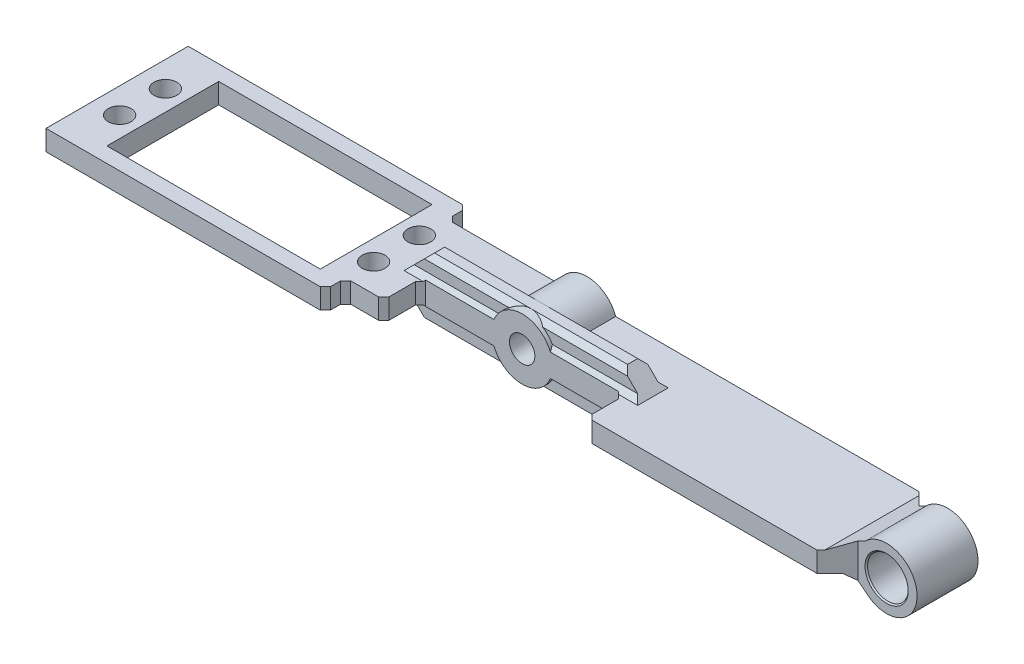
ISO-10303-21;
HEADER;
FILE_DESCRIPTION(('STEP AP214'),'2;1');
FILE_NAME('part.step','',(''),(''),'','','');
FILE_SCHEMA(('AUTOMOTIVE_DESIGN { 1 0 10303 214 1 1 1 1 }'));
ENDSEC;
DATA;
#1=APPLICATION_CONTEXT('core data for automotive mechanical design processes');
#2=APPLICATION_PROTOCOL_DEFINITION('international standard','automotive_design',2000,#1);
#3=PRODUCT_CONTEXT('',#1,'mechanical');
#4=PRODUCT('Part','Part','',(#3));
#5=PRODUCT_RELATED_PRODUCT_CATEGORY('part','',(#4));
#6=PRODUCT_DEFINITION_FORMATION('','',#4);
#7=PRODUCT_DEFINITION_CONTEXT('part definition',#1,'design');
#8=PRODUCT_DEFINITION('design','',#6,#7);
#9=PRODUCT_DEFINITION_SHAPE('','',#8);
#10=(LENGTH_UNIT() NAMED_UNIT(*) SI_UNIT(.MILLI.,.METRE.));
#11=(NAMED_UNIT(*) PLANE_ANGLE_UNIT() SI_UNIT($,.RADIAN.));
#12=(NAMED_UNIT(*) SI_UNIT($,.STERADIAN.) SOLID_ANGLE_UNIT());
#13=UNCERTAINTY_MEASURE_WITH_UNIT(LENGTH_MEASURE(1.E-05),#10,'distance_accuracy_value','');
#14=(GEOMETRIC_REPRESENTATION_CONTEXT(3) GLOBAL_UNCERTAINTY_ASSIGNED_CONTEXT((#13)) GLOBAL_UNIT_ASSIGNED_CONTEXT((#10,
#11,#12)) REPRESENTATION_CONTEXT('',''));
#15=CARTESIAN_POINT('',(0.,0.,0.));
#16=DIRECTION('',(0.,0.,1.));
#17=DIRECTION('',(1.,0.,0.));
#18=AXIS2_PLACEMENT_3D('',#15,#16,#17);
#19=CARTESIAN_POINT('',(0.,-4.,-6.));
#20=DIRECTION('',(0.,0.,1.));
#21=DIRECTION('',(1.,0.,0.));
#22=AXIS2_PLACEMENT_3D('',#19,#20,#21);
#23=PLANE('',#22);
#24=CARTESIAN_POINT('',(75.,2.,-6.));
#25=DIRECTION('',(0.,0.,1.));
#26=DIRECTION('',(1.,0.,0.));
#27=AXIS2_PLACEMENT_3D('',#24,#25,#26);
#28=CIRCLE('',#27,4.25000000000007);
#29=CARTESIAN_POINT('',(79.2500000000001,2.,-6.));
#30=VERTEX_POINT('',#29);
#31=EDGE_CURVE('E47',#30,#30,#28,.T.);
#32=ORIENTED_EDGE('',*,*,#31,.T.);
#33=EDGE_LOOP('',(#32));
#34=FACE_BOUND('',#33,.T.);
#35=CARTESIAN_POINT('',(75.,2.,-6.));
#36=DIRECTION('',(0.,0.,1.));
#37=DIRECTION('',(1.,0.,0.));
#38=AXIS2_PLACEMENT_3D('',#35,#36,#37);
#39=CIRCLE('',#38,6.);
#40=CARTESIAN_POINT('',(71.0880266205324,-2.54933668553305,-6.));
#41=VERTEX_POINT('',#40);
#42=CARTESIAN_POINT('',(70.7573593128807,6.24264068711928,-6.));
#43=VERTEX_POINT('',#42);
#44=EDGE_CURVE('E968',#41,#43,#39,.T.);
#45=ORIENTED_EDGE('',*,*,#44,.F.);
#46=DIRECTION('',(-0.783018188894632,0.621998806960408,0.));
#47=VECTOR('',#46,1.);
#48=CARTESIAN_POINT('',(28.2092403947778,31.5118821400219,-6.));
#49=LINE('',#48,#47);
#50=CARTESIAN_POINT('',(69.3431457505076,-1.1632720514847,-6.));
#51=VERTEX_POINT('',#50);
#52=EDGE_CURVE('E839',#41,#51,#49,.T.);
#53=ORIENTED_EDGE('',*,*,#52,.T.);
#54=DIRECTION('',(0.,1.,0.));
#55=VECTOR('',#54,1.);
#56=CARTESIAN_POINT('',(69.3431457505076,-4.,-6.));
#57=LINE('',#56,#55);
#58=CARTESIAN_POINT('',(69.3431457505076,5.56722324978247,-6.));
#59=VERTEX_POINT('',#58);
#60=EDGE_CURVE('E969',#51,#59,#57,.T.);
#61=ORIENTED_EDGE('',*,*,#60,.T.);
#62=DIRECTION('',(0.902368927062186,0.430964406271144,0.));
#63=VECTOR('',#62,1.);
#64=CARTESIAN_POINT('',(9.15853779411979,-23.1764790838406,-6.));
#65=LINE('',#64,#63);
#66=EDGE_CURVE('E826',#59,#43,#65,.T.);
#67=ORIENTED_EDGE('',*,*,#66,.T.);
#68=EDGE_LOOP('',(#45,#53,#61,#67));
#69=FACE_BOUND('',#68,.T.);
#70=ADVANCED_FACE('F39',(#34,#69),#23,.F.);
#71=CARTESIAN_POINT('',(0.,-4.,6.));
#72=DIRECTION('',(0.,0.,1.));
#73=DIRECTION('',(1.,0.,0.));
#74=AXIS2_PLACEMENT_3D('',#71,#72,#73);
#75=PLANE('',#74);
#76=CARTESIAN_POINT('',(75.,2.,6.));
#77=DIRECTION('',(0.,0.,1.));
#78=DIRECTION('',(1.,0.,0.));
#79=AXIS2_PLACEMENT_3D('',#76,#77,#78);
#80=CIRCLE('',#79,4.24999999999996);
#81=CARTESIAN_POINT('',(79.25,2.,6.));
#82=VERTEX_POINT('',#81);
#83=EDGE_CURVE('E11',#82,#82,#80,.F.);
#84=ORIENTED_EDGE('',*,*,#83,.T.);
#85=EDGE_LOOP('',(#84));
#86=FACE_BOUND('',#85,.T.);
#87=DIRECTION('',(0.,1.,0.));
#88=VECTOR('',#87,1.);
#89=CARTESIAN_POINT('',(69.3431457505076,-4.,6.));
#90=LINE('',#89,#88);
#91=CARTESIAN_POINT('',(69.3431457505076,-1.16327205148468,6.));
#92=VERTEX_POINT('',#91);
#93=CARTESIAN_POINT('',(69.3431457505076,5.56722324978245,6.));
#94=VERTEX_POINT('',#93);
#95=EDGE_CURVE('E962',#92,#94,#90,.T.);
#96=ORIENTED_EDGE('',*,*,#95,.F.);
#97=DIRECTION('',(0.783018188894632,-0.621998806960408,0.));
#98=VECTOR('',#97,1.);
#99=CARTESIAN_POINT('',(71.0880266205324,-2.54933668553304,6.));
#100=LINE('',#99,#98);
#101=CARTESIAN_POINT('',(71.0880266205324,-2.54933668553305,6.));
#102=VERTEX_POINT('',#101);
#103=EDGE_CURVE('E847',#92,#102,#100,.T.);
#104=ORIENTED_EDGE('',*,*,#103,.T.);
#105=CARTESIAN_POINT('',(75.,2.,6.));
#106=DIRECTION('',(0.,0.,1.));
#107=DIRECTION('',(1.,0.,0.));
#108=AXIS2_PLACEMENT_3D('',#105,#106,#107);
#109=CIRCLE('',#108,6.);
#110=CARTESIAN_POINT('',(70.7573593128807,6.24264068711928,6.));
#111=VERTEX_POINT('',#110);
#112=EDGE_CURVE('E983',#102,#111,#109,.T.);
#113=ORIENTED_EDGE('',*,*,#112,.T.);
#114=DIRECTION('',(-0.902368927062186,-0.430964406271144,0.));
#115=VECTOR('',#114,1.);
#116=CARTESIAN_POINT('',(66.0616367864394,4.,6.));
#117=LINE('',#116,#115);
#118=EDGE_CURVE('E829',#111,#94,#117,.T.);
#119=ORIENTED_EDGE('',*,*,#118,.T.);
#120=EDGE_LOOP('',(#96,#104,#113,#119));
#121=FACE_BOUND('',#120,.T.);
#122=ADVANCED_FACE('F958',(#86,#121),#75,.T.);
#123=CARTESIAN_POINT('',(0.,4.,-10.));
#124=DIRECTION('',(0.,0.,-1.));
#125=DIRECTION('',(-1.,0.,0.));
#126=AXIS2_PLACEMENT_3D('',#123,#124,#125);
#127=PLANE('',#126);
#128=CARTESIAN_POINT('',(0.,2.,-10.));
#129=DIRECTION('',(0.,0.,-1.));
#130=DIRECTION('',(-1.,0.,0.));
#131=AXIS2_PLACEMENT_3D('',#128,#129,#130);
#132=CIRCLE('',#131,3.75000000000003);
#133=CARTESIAN_POINT('',(-3.75000000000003,2.,-10.));
#134=VERTEX_POINT('',#133);
#135=EDGE_CURVE('E799',#134,#134,#132,.F.);
#136=ORIENTED_EDGE('',*,*,#135,.T.);
#137=EDGE_LOOP('',(#136));
#138=FACE_BOUND('',#137,.T.);
#139=DIRECTION('',(1.,0.,0.));
#140=VECTOR('',#139,1.);
#141=CARTESIAN_POINT('',(0.,0.,-10.));
#142=LINE('',#141,#140);
#143=CARTESIAN_POINT('',(-26.5,0.,-10.));
#144=VERTEX_POINT('',#143);
#145=CARTESIAN_POINT('',(-5.65685424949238,0.,-10.));
#146=VERTEX_POINT('',#145);
#147=EDGE_CURVE('E440',#144,#146,#142,.T.);
#148=ORIENTED_EDGE('',*,*,#147,.F.);
#149=DIRECTION('',(0.,1.,0.));
#150=VECTOR('',#149,1.);
#151=CARTESIAN_POINT('',(-26.5,4.,-10.));
#152=LINE('',#151,#150);
#153=CARTESIAN_POINT('',(-26.5,4.,-10.));
#154=VERTEX_POINT('',#153);
#155=EDGE_CURVE('E892',#144,#154,#152,.T.);
#156=ORIENTED_EDGE('',*,*,#155,.T.);
#157=DIRECTION('',(1.,0.,0.));
#158=VECTOR('',#157,1.);
#159=CARTESIAN_POINT('',(0.,4.,-10.));
#160=LINE('',#159,#158);
#161=CARTESIAN_POINT('',(-5.65685424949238,4.,-10.));
#162=VERTEX_POINT('',#161);
#163=EDGE_CURVE('E521',#154,#162,#160,.T.);
#164=ORIENTED_EDGE('',*,*,#163,.T.);
#165=CARTESIAN_POINT('',(0.,2.,-10.));
#166=DIRECTION('',(0.,0.,-1.));
#167=DIRECTION('',(-1.,0.,0.));
#168=AXIS2_PLACEMENT_3D('',#165,#166,#167);
#169=CIRCLE('',#168,6.);
#170=CARTESIAN_POINT('',(5.65685424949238,4.,-10.));
#171=VERTEX_POINT('',#170);
#172=EDGE_CURVE('E468',#171,#162,#169,.F.);
#173=ORIENTED_EDGE('',*,*,#172,.F.);
#174=CARTESIAN_POINT('',(65.3431457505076,4.,-10.));
#175=VERTEX_POINT('',#174);
#176=EDGE_CURVE('E520',#171,#175,#160,.T.);
#177=ORIENTED_EDGE('',*,*,#176,.T.);
#178=DIRECTION('',(0.,-1.,0.));
#179=VECTOR('',#178,1.);
#180=CARTESIAN_POINT('',(65.3431457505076,4.,-10.));
#181=LINE('',#180,#179);
#182=CARTESIAN_POINT('',(65.3431457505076,0.,-10.));
#183=VERTEX_POINT('',#182);
#184=EDGE_CURVE('E807',#175,#183,#181,.T.);
#185=ORIENTED_EDGE('',*,*,#184,.T.);
#186=CARTESIAN_POINT('',(5.65685424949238,0.,-10.));
#187=VERTEX_POINT('',#186);
#188=EDGE_CURVE('E453',#187,#183,#142,.T.);
#189=ORIENTED_EDGE('',*,*,#188,.F.);
#190=EDGE_CURVE('E460',#146,#187,#169,.F.);
#191=ORIENTED_EDGE('',*,*,#190,.F.);
#192=EDGE_LOOP('',(#148,#156,#164,#173,#177,#185,#189,#191));
#193=FACE_BOUND('',#192,.T.);
#194=ADVANCED_FACE('F466',(#138,#193),#127,.T.);
#195=CARTESIAN_POINT('',(82.5,0.,9.99999999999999));
#196=DIRECTION('',(0.,0.,-1.));
#197=DIRECTION('',(-1.,0.,0.));
#198=AXIS2_PLACEMENT_3D('',#195,#196,#197);
#199=PLANE('',#198);
#200=DIRECTION('',(-1.,0.,0.));
#201=VECTOR('',#200,1.);
#202=CARTESIAN_POINT('',(82.5,4.,9.99999999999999));
#203=LINE('',#202,#201);
#204=CARTESIAN_POINT('',(65.3431457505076,4.,9.99999999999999));
#205=VERTEX_POINT('',#204);
#206=CARTESIAN_POINT('',(21.,4.,9.99999999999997));
#207=VERTEX_POINT('',#206);
#208=EDGE_CURVE('E485',#205,#207,#203,.T.);
#209=ORIENTED_EDGE('',*,*,#208,.T.);
#210=DIRECTION('',(0.,-1.,0.));
#211=VECTOR('',#210,1.);
#212=CARTESIAN_POINT('',(21.,0.,9.99999999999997));
#213=LINE('',#212,#211);
#214=CARTESIAN_POINT('',(21.,0.,9.99999999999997));
#215=VERTEX_POINT('',#214);
#216=EDGE_CURVE('E856',#207,#215,#213,.T.);
#217=ORIENTED_EDGE('',*,*,#216,.T.);
#218=DIRECTION('',(-1.,0.,0.));
#219=VECTOR('',#218,1.);
#220=CARTESIAN_POINT('',(82.5,0.,9.99999999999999));
#221=LINE('',#220,#219);
#222=CARTESIAN_POINT('',(65.3431457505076,0.,9.99999999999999));
#223=VERTEX_POINT('',#222);
#224=EDGE_CURVE('E486',#223,#215,#221,.T.);
#225=ORIENTED_EDGE('',*,*,#224,.F.);
#226=DIRECTION('',(0.,1.,0.));
#227=VECTOR('',#226,1.);
#228=CARTESIAN_POINT('',(65.3431457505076,3.99999999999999,9.99999999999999));
#229=LINE('',#228,#227);
#230=EDGE_CURVE('E814',#223,#205,#229,.T.);
#231=ORIENTED_EDGE('',*,*,#230,.T.);
#232=EDGE_LOOP('',(#209,#217,#225,#231));
#233=FACE_BOUND('',#232,.T.);
#234=ADVANCED_FACE('F1172',(#233),#199,.F.);
#235=CARTESIAN_POINT('',(75.,2.,10.));
#236=DIRECTION('',(0.,0.,-1.));
#237=DIRECTION('',(-1.,0.,0.));
#238=AXIS2_PLACEMENT_3D('',#235,#236,#237);
#239=CYLINDRICAL_SURFACE('',#238,6.);
#240=ORIENTED_EDGE('',*,*,#112,.F.);
#241=DIRECTION('',(0.,0.,-1.));
#242=VECTOR('',#241,1.);
#243=CARTESIAN_POINT('',(71.0880266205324,-2.54933668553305,10.));
#244=LINE('',#243,#242);
#245=EDGE_CURVE('E834',#102,#41,#244,.T.);
#246=ORIENTED_EDGE('',*,*,#245,.T.);
#247=ORIENTED_EDGE('',*,*,#44,.T.);
#248=DIRECTION('',(0.,0.,-1.));
#249=VECTOR('',#248,1.);
#250=CARTESIAN_POINT('',(70.7573593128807,6.24264068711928,10.));
#251=LINE('',#250,#249);
#252=EDGE_CURVE('E820',#43,#111,#251,.F.);
#253=ORIENTED_EDGE('',*,*,#252,.T.);
#254=EDGE_LOOP('',(#240,#246,#247,#253));
#255=FACE_BOUND('',#254,.T.);
#256=ADVANCED_FACE('F982',(#255),#239,.T.);
#257=CARTESIAN_POINT('',(0.,0.,0.));
#258=DIRECTION('',(0.,1.,0.));
#259=DIRECTION('',(0.,0.,1.));
#260=AXIS2_PLACEMENT_3D('',#257,#258,#259);
#261=PLANE('',#260);
#262=ORIENTED_EDGE('',*,*,#224,.T.);
#263=DIRECTION('',(0.707106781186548,0.,0.707106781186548));
#264=VECTOR('',#263,1.);
#265=CARTESIAN_POINT('',(20.,0.,8.99999999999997));
#266=LINE('',#265,#264);
#267=CARTESIAN_POINT('',(20.,0.,8.99999999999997));
#268=VERTEX_POINT('',#267);
#269=EDGE_CURVE('E858',#215,#268,#266,.F.);
#270=ORIENTED_EDGE('',*,*,#269,.T.);
#271=DIRECTION('',(0.,0.,-1.));
#272=VECTOR('',#271,1.);
#273=CARTESIAN_POINT('',(20.,0.,0.));
#274=LINE('',#273,#272);
#275=CARTESIAN_POINT('',(20.,0.,3.75000000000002));
#276=VERTEX_POINT('',#275);
#277=EDGE_CURVE('E495',#268,#276,#274,.T.);
#278=ORIENTED_EDGE('',*,*,#277,.T.);
#279=DIRECTION('',(-0.707106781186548,0.,-0.707106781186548));
#280=VECTOR('',#279,1.);
#281=CARTESIAN_POINT('',(8.12499999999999,0.,-8.12499999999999));
#282=LINE('',#281,#280);
#283=CARTESIAN_POINT('',(19.25,0.,3.00000000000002));
#284=VERTEX_POINT('',#283);
#285=EDGE_CURVE('E910',#276,#284,#282,.T.);
#286=ORIENTED_EDGE('',*,*,#285,.T.);
#287=DIRECTION('',(1.,0.,0.));
#288=VECTOR('',#287,1.);
#289=CARTESIAN_POINT('',(0.,0.,3.00000000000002));
#290=LINE('',#289,#288);
#291=CARTESIAN_POINT('',(23.,0.,3.00000000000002));
#292=VERTEX_POINT('',#291);
#293=EDGE_CURVE('E677',#284,#292,#290,.T.);
#294=ORIENTED_EDGE('',*,*,#293,.T.);
#295=DIRECTION('',(0.,0.,1.));
#296=VECTOR('',#295,1.);
#297=CARTESIAN_POINT('',(23.,0.,-2.));
#298=LINE('',#297,#296);
#299=CARTESIAN_POINT('',(23.,0.,-3.));
#300=VERTEX_POINT('',#299);
#301=EDGE_CURVE('E1001',#300,#292,#298,.T.);
#302=ORIENTED_EDGE('',*,*,#301,.F.);
#303=DIRECTION('',(-1.,0.,0.));
#304=VECTOR('',#303,1.);
#305=CARTESIAN_POINT('',(5.65685424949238,0.,-3.));
#306=LINE('',#305,#304);
#307=CARTESIAN_POINT('',(5.65685424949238,0.,-3.));
#308=VERTEX_POINT('',#307);
#309=EDGE_CURVE('E680',#300,#308,#306,.T.);
#310=ORIENTED_EDGE('',*,*,#309,.T.);
#311=DIRECTION('',(0.,0.,1.));
#312=VECTOR('',#311,1.);
#313=CARTESIAN_POINT('',(5.65685424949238,0.,-26.9705627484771));
#314=LINE('',#313,#312);
#315=EDGE_CURVE('E464',#308,#187,#314,.F.);
#316=ORIENTED_EDGE('',*,*,#315,.T.);
#317=ORIENTED_EDGE('',*,*,#188,.T.);
#318=DIRECTION('',(-0.70710678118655,0.,-0.707106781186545));
#319=VECTOR('',#318,1.);
#320=CARTESIAN_POINT('',(69.3431457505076,0.,-6.00000000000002));
#321=LINE('',#320,#319);
#322=CARTESIAN_POINT('',(67.8787326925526,0.,-7.46441305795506));
#323=VERTEX_POINT('',#322);
#324=EDGE_CURVE('E811',#183,#323,#321,.F.);
#325=ORIENTED_EDGE('',*,*,#324,.T.);
#326=DIRECTION('',(0.,0.,1.));
#327=VECTOR('',#326,1.);
#328=CARTESIAN_POINT('',(67.8787326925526,0.,6.));
#329=LINE('',#328,#327);
#330=CARTESIAN_POINT('',(67.8787326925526,0.,7.46441305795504));
#331=VERTEX_POINT('',#330);
#332=EDGE_CURVE('E837',#323,#331,#329,.T.);
#333=ORIENTED_EDGE('',*,*,#332,.T.);
#334=DIRECTION('',(-0.707106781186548,0.,0.707106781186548));
#335=VECTOR('',#334,1.);
#336=CARTESIAN_POINT('',(65.3431457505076,0.,9.99999999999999));
#337=LINE('',#336,#335);
#338=EDGE_CURVE('E809',#331,#223,#337,.T.);
#339=ORIENTED_EDGE('',*,*,#338,.T.);
#340=EDGE_LOOP('',(#262,#270,#278,#286,#294,#302,#310,#316,#317,#325,#333,#339));
#341=FACE_BOUND('',#340,.T.);
#342=ADVANCED_FACE('F1067',(#341),#261,.F.);
#343=CARTESIAN_POINT('',(0.,4.,0.));
#344=DIRECTION('',(0.,1.,0.));
#345=DIRECTION('',(0.,0.,1.));
#346=AXIS2_PLACEMENT_3D('',#343,#344,#345);
#347=PLANE('',#346);
#348=DIRECTION('',(0.,0.,-1.));
#349=VECTOR('',#348,1.);
#350=CARTESIAN_POINT('',(20.,4.,0.));
#351=LINE('',#350,#349);
#352=CARTESIAN_POINT('',(20.,4.,8.99999999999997));
#353=VERTEX_POINT('',#352);
#354=CARTESIAN_POINT('',(20.,4.,3.75000000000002));
#355=VERTEX_POINT('',#354);
#356=EDGE_CURVE('E489',#353,#355,#351,.T.);
#357=ORIENTED_EDGE('',*,*,#356,.F.);
#358=DIRECTION('',(-0.707106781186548,0.,-0.707106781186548));
#359=VECTOR('',#358,1.);
#360=CARTESIAN_POINT('',(5.50000000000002,4.,-5.50000000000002));
#361=LINE('',#360,#359);
#362=EDGE_CURVE('E854',#353,#207,#361,.F.);
#363=ORIENTED_EDGE('',*,*,#362,.T.);
#364=ORIENTED_EDGE('',*,*,#208,.F.);
#365=DIRECTION('',(0.707106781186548,0.,-0.707106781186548));
#366=VECTOR('',#365,1.);
#367=CARTESIAN_POINT('',(37.6715728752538,4.,37.6715728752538));
#368=LINE('',#367,#366);
#369=CARTESIAN_POINT('',(66.0616367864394,4.,9.28150896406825));
#370=VERTEX_POINT('',#369);
#371=EDGE_CURVE('E802',#205,#370,#368,.T.);
#372=ORIENTED_EDGE('',*,*,#371,.T.);
#373=DIRECTION('',(0.,0.,-1.));
#374=VECTOR('',#373,1.);
#375=CARTESIAN_POINT('',(66.0616367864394,4.,0.));
#376=LINE('',#375,#374);
#377=CARTESIAN_POINT('',(66.0616367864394,4.,-9.28150896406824));
#378=VERTEX_POINT('',#377);
#379=EDGE_CURVE('E817',#370,#378,#376,.T.);
#380=ORIENTED_EDGE('',*,*,#379,.T.);
#381=DIRECTION('',(0.70710678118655,0.,0.707106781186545));
#382=VECTOR('',#381,1.);
#383=CARTESIAN_POINT('',(37.6715728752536,4.,-37.6715728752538));
#384=LINE('',#383,#382);
#385=EDGE_CURVE('E805',#378,#175,#384,.F.);
#386=ORIENTED_EDGE('',*,*,#385,.T.);
#387=ORIENTED_EDGE('',*,*,#176,.F.);
#388=DIRECTION('',(0.,0.,1.));
#389=VECTOR('',#388,1.);
#390=CARTESIAN_POINT('',(5.65685424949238,4.,-26.9705627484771));
#391=LINE('',#390,#389);
#392=CARTESIAN_POINT('',(5.65685424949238,4.,-3.));
#393=VERTEX_POINT('',#392);
#394=EDGE_CURVE('E463',#393,#171,#391,.F.);
#395=ORIENTED_EDGE('',*,*,#394,.F.);
#396=DIRECTION('',(1.,0.,0.));
#397=VECTOR('',#396,1.);
#398=CARTESIAN_POINT('',(23.,4.,-3.));
#399=LINE('',#398,#397);
#400=CARTESIAN_POINT('',(23.,4.,-3.));
#401=VERTEX_POINT('',#400);
#402=EDGE_CURVE('E709',#393,#401,#399,.T.);
#403=ORIENTED_EDGE('',*,*,#402,.T.);
#404=DIRECTION('',(0.,0.,1.));
#405=VECTOR('',#404,1.);
#406=CARTESIAN_POINT('',(23.,4.,-2.));
#407=LINE('',#406,#405);
#408=CARTESIAN_POINT('',(23.,4.,3.00000000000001));
#409=VERTEX_POINT('',#408);
#410=EDGE_CURVE('E1003',#401,#409,#407,.T.);
#411=ORIENTED_EDGE('',*,*,#410,.T.);
#412=DIRECTION('',(-1.,0.,0.));
#413=VECTOR('',#412,1.);
#414=CARTESIAN_POINT('',(0.,4.,3.00000000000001));
#415=LINE('',#414,#413);
#416=CARTESIAN_POINT('',(19.25,4.,3.00000000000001));
#417=VERTEX_POINT('',#416);
#418=EDGE_CURVE('E707',#409,#417,#415,.T.);
#419=ORIENTED_EDGE('',*,*,#418,.T.);
#420=DIRECTION('',(0.707106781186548,0.,0.707106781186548));
#421=VECTOR('',#420,1.);
#422=CARTESIAN_POINT('',(19.,4.,2.75));
#423=LINE('',#422,#421);
#424=EDGE_CURVE('E908',#417,#355,#423,.T.);
#425=ORIENTED_EDGE('',*,*,#424,.T.);
#426=EDGE_LOOP('',(#357,#363,#364,#372,#380,#386,#387,#395,#403,#411,#419,#425));
#427=FACE_BOUND('',#426,.T.);
#428=ADVANCED_FACE('F1134',(#427),#347,.T.);
#429=CARTESIAN_POINT('',(-27.5,0.,-4.49999999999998));
#430=DIRECTION('',(0.,1.,0.));
#431=DIRECTION('',(0.,0.,1.));
#432=AXIS2_PLACEMENT_3D('',#429,#430,#431);
#433=CIRCLE('',#432,2.25);
#434=CARTESIAN_POINT('',(-27.5,0.,-2.24999999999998));
#435=VERTEX_POINT('',#434);
#436=EDGE_CURVE('E502',#435,#435,#433,.T.);
#437=ORIENTED_EDGE('',*,*,#436,.T.);
#438=EDGE_LOOP('',(#437));
#439=FACE_BOUND('',#438,.T.);
#440=CARTESIAN_POINT('',(-27.5,0.,4.50000000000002));
#441=DIRECTION('',(0.,1.,0.));
#442=DIRECTION('',(0.,0.,1.));
#443=AXIS2_PLACEMENT_3D('',#440,#441,#442);
#444=CIRCLE('',#443,2.25);
#445=CARTESIAN_POINT('',(-27.5,0.,6.75000000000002));
#446=VERTEX_POINT('',#445);
#447=EDGE_CURVE('E549',#446,#446,#444,.T.);
#448=ORIENTED_EDGE('',*,*,#447,.T.);
#449=EDGE_LOOP('',(#448));
#450=FACE_BOUND('',#449,.T.);
#451=CARTESIAN_POINT('',(-77.5,0.,4.50000000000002));
#452=DIRECTION('',(0.,1.,0.));
#453=DIRECTION('',(0.,0.,1.));
#454=AXIS2_PLACEMENT_3D('',#451,#452,#453);
#455=CIRCLE('',#454,2.25);
#456=CARTESIAN_POINT('',(-77.5,0.,6.75000000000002));
#457=VERTEX_POINT('',#456);
#458=EDGE_CURVE('E552',#457,#457,#455,.T.);
#459=ORIENTED_EDGE('',*,*,#458,.T.);
#460=EDGE_LOOP('',(#459));
#461=FACE_BOUND('',#460,.T.);
#462=CARTESIAN_POINT('',(-77.5,0.,-4.49999999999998));
#463=DIRECTION('',(0.,1.,0.));
#464=DIRECTION('',(0.,0.,1.));
#465=AXIS2_PLACEMENT_3D('',#462,#463,#464);
#466=CIRCLE('',#465,2.25);
#467=CARTESIAN_POINT('',(-77.5,0.,-2.24999999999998));
#468=VERTEX_POINT('',#467);
#469=EDGE_CURVE('E555',#468,#468,#466,.T.);
#470=ORIENTED_EDGE('',*,*,#469,.T.);
#471=EDGE_LOOP('',(#470));
#472=FACE_BOUND('',#471,.T.);
#473=DIRECTION('',(0.,0.,-1.));
#474=VECTOR('',#473,1.);
#475=CARTESIAN_POINT('',(-31.5,0.,0.));
#476=LINE('',#475,#474);
#477=CARTESIAN_POINT('',(-31.5,0.,11.));
#478=VERTEX_POINT('',#477);
#479=CARTESIAN_POINT('',(-31.5,0.,-11.));
#480=VERTEX_POINT('',#479);
#481=EDGE_CURVE('E568',#478,#480,#476,.T.);
#482=ORIENTED_EDGE('',*,*,#481,.T.);
#483=DIRECTION('',(1.,0.,0.));
#484=VECTOR('',#483,1.);
#485=CARTESIAN_POINT('',(0.,0.,-11.));
#486=LINE('',#485,#484);
#487=CARTESIAN_POINT('',(-73.5,0.,-11.));
#488=VERTEX_POINT('',#487);
#489=EDGE_CURVE('E511',#488,#480,#486,.T.);
#490=ORIENTED_EDGE('',*,*,#489,.F.);
#491=DIRECTION('',(0.,0.,-1.));
#492=VECTOR('',#491,1.);
#493=CARTESIAN_POINT('',(-73.5,0.,0.));
#494=LINE('',#493,#492);
#495=CARTESIAN_POINT('',(-73.5,0.,11.));
#496=VERTEX_POINT('',#495);
#497=EDGE_CURVE('E574',#496,#488,#494,.T.);
#498=ORIENTED_EDGE('',*,*,#497,.F.);
#499=DIRECTION('',(1.,0.,0.));
#500=VECTOR('',#499,1.);
#501=CARTESIAN_POINT('',(0.,0.,11.));
#502=LINE('',#501,#500);
#503=EDGE_CURVE('E571',#496,#478,#502,.T.);
#504=ORIENTED_EDGE('',*,*,#503,.T.);
#505=EDGE_LOOP('',(#482,#490,#498,#504));
#506=FACE_BOUND('',#505,.T.);
#507=DIRECTION('',(0.,0.,-1.));
#508=VECTOR('',#507,1.);
#509=CARTESIAN_POINT('',(-20.,0.,0.));
#510=LINE('',#509,#508);
#511=CARTESIAN_POINT('',(-20.,0.,8.99999999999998));
#512=VERTEX_POINT('',#511);
#513=CARTESIAN_POINT('',(-20.,0.,3.75));
#514=VERTEX_POINT('',#513);
#515=EDGE_CURVE('E498',#512,#514,#510,.T.);
#516=ORIENTED_EDGE('',*,*,#515,.F.);
#517=DIRECTION('',(-0.70710678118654,0.,0.707106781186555));
#518=VECTOR('',#517,1.);
#519=CARTESIAN_POINT('',(-21.,0.,9.99999999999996));
#520=LINE('',#519,#518);
#521=CARTESIAN_POINT('',(-21.,0.,9.99999999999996));
#522=VERTEX_POINT('',#521);
#523=EDGE_CURVE('E885',#512,#522,#520,.T.);
#524=ORIENTED_EDGE('',*,*,#523,.T.);
#525=CARTESIAN_POINT('',(-26.5,0.,9.99999999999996));
#526=VERTEX_POINT('',#525);
#527=EDGE_CURVE('E484',#522,#526,#221,.T.);
#528=ORIENTED_EDGE('',*,*,#527,.T.);
#529=DIRECTION('',(-0.707106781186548,0.,0.707106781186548));
#530=VECTOR('',#529,1.);
#531=CARTESIAN_POINT('',(-8.25000000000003,0.,-8.25000000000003));
#532=LINE('',#531,#530);
#533=CARTESIAN_POINT('',(-27.5,0.,11.));
#534=VERTEX_POINT('',#533);
#535=EDGE_CURVE('E928',#526,#534,#532,.T.);
#536=ORIENTED_EDGE('',*,*,#535,.T.);
#537=DIRECTION('',(0.,0.,-1.));
#538=VECTOR('',#537,1.);
#539=CARTESIAN_POINT('',(-27.5,0.,14.));
#540=LINE('',#539,#538);
#541=CARTESIAN_POINT('',(-27.5,0.,13.));
#542=VERTEX_POINT('',#541);
#543=EDGE_CURVE('E481',#542,#534,#540,.T.);
#544=ORIENTED_EDGE('',*,*,#543,.F.);
#545=DIRECTION('',(-0.707106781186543,0.,0.707106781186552));
#546=VECTOR('',#545,1.);
#547=CARTESIAN_POINT('',(-28.5000000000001,0.,14.));
#548=LINE('',#547,#546);
#549=CARTESIAN_POINT('',(-28.5000000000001,0.,14.));
#550=VERTEX_POINT('',#549);
#551=EDGE_CURVE('E881',#542,#550,#548,.T.);
#552=ORIENTED_EDGE('',*,*,#551,.T.);
#553=DIRECTION('',(1.,0.,0.));
#554=VECTOR('',#553,1.);
#555=CARTESIAN_POINT('',(0.,0.,14.));
#556=LINE('',#555,#554);
#557=CARTESIAN_POINT('',(-82.5,0.,14.));
#558=VERTEX_POINT('',#557);
#559=EDGE_CURVE('E565',#558,#550,#556,.T.);
#560=ORIENTED_EDGE('',*,*,#559,.F.);
#561=DIRECTION('',(0.,0.,-1.));
#562=VECTOR('',#561,1.);
#563=CARTESIAN_POINT('',(-82.5,0.,0.));
#564=LINE('',#563,#562);
#565=CARTESIAN_POINT('',(-82.5,0.,-14.));
#566=VERTEX_POINT('',#565);
#567=EDGE_CURVE('E562',#558,#566,#564,.T.);
#568=ORIENTED_EDGE('',*,*,#567,.T.);
#569=DIRECTION('',(1.,0.,0.));
#570=VECTOR('',#569,1.);
#571=CARTESIAN_POINT('',(0.,0.,-14.));
#572=LINE('',#571,#570);
#573=CARTESIAN_POINT('',(-28.5,0.,-14.));
#574=VERTEX_POINT('',#573);
#575=EDGE_CURVE('E559',#566,#574,#572,.T.);
#576=ORIENTED_EDGE('',*,*,#575,.T.);
#577=DIRECTION('',(-0.707106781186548,0.,-0.707106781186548));
#578=VECTOR('',#577,1.);
#579=CARTESIAN_POINT('',(-28.5,0.,-14.));
#580=LINE('',#579,#578);
#581=CARTESIAN_POINT('',(-27.5,0.,-13.));
#582=VERTEX_POINT('',#581);
#583=EDGE_CURVE('E883',#574,#582,#580,.F.);
#584=ORIENTED_EDGE('',*,*,#583,.T.);
#585=DIRECTION('',(0.,0.,1.));
#586=VECTOR('',#585,1.);
#587=CARTESIAN_POINT('',(-27.5,0.,0.));
#588=LINE('',#587,#586);
#589=CARTESIAN_POINT('',(-27.5,0.,-11.));
#590=VERTEX_POINT('',#589);
#591=EDGE_CURVE('E452',#582,#590,#588,.T.);
#592=ORIENTED_EDGE('',*,*,#591,.T.);
#593=DIRECTION('',(-0.707106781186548,0.,-0.707106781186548));
#594=VECTOR('',#593,1.);
#595=CARTESIAN_POINT('',(-8.25000000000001,0.,8.25000000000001));
#596=LINE('',#595,#594);
#597=EDGE_CURVE('E448',#590,#144,#596,.F.);
#598=ORIENTED_EDGE('',*,*,#597,.T.);
#599=ORIENTED_EDGE('',*,*,#147,.T.);
#600=DIRECTION('',(0.,0.,1.));
#601=VECTOR('',#600,1.);
#602=CARTESIAN_POINT('',(-5.65685424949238,0.,-26.9705627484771));
#603=LINE('',#602,#601);
#604=CARTESIAN_POINT('',(-5.65685424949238,0.,-3.));
#605=VERTEX_POINT('',#604);
#606=EDGE_CURVE('E445',#146,#605,#603,.T.);
#607=ORIENTED_EDGE('',*,*,#606,.T.);
#608=DIRECTION('',(-1.,0.,0.));
#609=VECTOR('',#608,1.);
#610=CARTESIAN_POINT('',(-23.,0.,-3.));
#611=LINE('',#610,#609);
#612=CARTESIAN_POINT('',(-23.,0.,-3.));
#613=VERTEX_POINT('',#612);
#614=EDGE_CURVE('E675',#605,#613,#611,.T.);
#615=ORIENTED_EDGE('',*,*,#614,.T.);
#616=DIRECTION('',(0.,0.,1.));
#617=VECTOR('',#616,1.);
#618=CARTESIAN_POINT('',(-23.,0.,-2.));
#619=LINE('',#618,#617);
#620=CARTESIAN_POINT('',(-23.,0.,3.00000000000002));
#621=VERTEX_POINT('',#620);
#622=EDGE_CURVE('E997',#613,#621,#619,.T.);
#623=ORIENTED_EDGE('',*,*,#622,.T.);
#624=DIRECTION('',(1.,0.,0.));
#625=VECTOR('',#624,1.);
#626=CARTESIAN_POINT('',(0.,0.,3.00000000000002));
#627=LINE('',#626,#625);
#628=CARTESIAN_POINT('',(-19.25,0.,3.00000000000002));
#629=VERTEX_POINT('',#628);
#630=EDGE_CURVE('E54',#621,#629,#627,.T.);
#631=ORIENTED_EDGE('',*,*,#630,.T.);
#632=DIRECTION('',(0.707106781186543,0.,-0.707106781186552));
#633=VECTOR('',#632,1.);
#634=CARTESIAN_POINT('',(-8.12500000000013,0.,-8.12500000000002));
#635=LINE('',#634,#633);
#636=EDGE_CURVE('E921',#629,#514,#635,.F.);
#637=ORIENTED_EDGE('',*,*,#636,.T.);
#638=EDGE_LOOP('',(#516,#524,#528,#536,#544,#552,#560,#568,#576,#584,#592,#598,#599,#607,#615,
#623,#631,#637));
#639=FACE_BOUND('',#638,.T.);
#640=ADVANCED_FACE('F443',(#439,#450,#461,#472,#506,#639),#261,.F.);
#641=CARTESIAN_POINT('',(0.,2.,-26.9705627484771));
#642=DIRECTION('',(0.,0.,1.));
#643=DIRECTION('',(1.,0.,0.));
#644=AXIS2_PLACEMENT_3D('',#641,#642,#643);
#645=CYLINDRICAL_SURFACE('',#644,6.);
#646=CARTESIAN_POINT('',(0.,2.,-2.));
#647=DIRECTION('',(0.,0.,1.));
#648=DIRECTION('',(1.,0.,0.));
#649=AXIS2_PLACEMENT_3D('',#646,#647,#648);
#650=CIRCLE('',#649,6.);
#651=CARTESIAN_POINT('',(-3.31662479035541,-3.,-2.));
#652=VERTEX_POINT('',#651);
#653=CARTESIAN_POINT('',(-5.19615242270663,-1.,-2.));
#654=VERTEX_POINT('',#653);
#655=EDGE_CURVE('E602',#652,#654,#650,.F.);
#656=ORIENTED_EDGE('',*,*,#655,.T.);
#657=CARTESIAN_POINT('',(0.,2.,-5.));
#658=DIRECTION('',(0.,-0.707106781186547,-0.707106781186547));
#659=DIRECTION('',(0.,-0.707106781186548,0.707106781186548));
#660=AXIS2_PLACEMENT_3D('',#657,#658,#659);
#661=ELLIPSE('',#660,8.48528137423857,6.);
#662=EDGE_CURVE('E462',#654,#605,#661,.T.);
#663=ORIENTED_EDGE('',*,*,#662,.T.);
#664=ORIENTED_EDGE('',*,*,#606,.F.);
#665=ORIENTED_EDGE('',*,*,#190,.T.);
#666=ORIENTED_EDGE('',*,*,#315,.F.);
#667=CARTESIAN_POINT('',(0.,2.,-5.));
#668=DIRECTION('',(0.,-0.707106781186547,-0.707106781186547));
#669=DIRECTION('',(0.,-0.707106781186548,0.707106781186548));
#670=AXIS2_PLACEMENT_3D('',#667,#668,#669);
#671=ELLIPSE('',#670,8.48528137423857,6.);
#672=CARTESIAN_POINT('',(5.19615242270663,-1.,-2.));
#673=VERTEX_POINT('',#672);
#674=EDGE_CURVE('E671',#308,#673,#671,.T.);
#675=ORIENTED_EDGE('',*,*,#674,.T.);
#676=CARTESIAN_POINT('',(3.3166247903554,-3.,-2.));
#677=VERTEX_POINT('',#676);
#678=EDGE_CURVE('E604',#673,#677,#650,.F.);
#679=ORIENTED_EDGE('',*,*,#678,.T.);
#680=CARTESIAN_POINT('',(0.,2.,-6.99999999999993));
#681=DIRECTION('',(0.,0.707106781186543,0.707106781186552));
#682=DIRECTION('',(0.,-0.707106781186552,0.707106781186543));
#683=AXIS2_PLACEMENT_3D('',#680,#681,#682);
#684=ELLIPSE('',#683,8.48528137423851,6.);
#685=CARTESIAN_POINT('',(0.,-4.,-1.00000000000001));
#686=VERTEX_POINT('',#685);
#687=EDGE_CURVE('E751',#677,#686,#684,.F.);
#688=ORIENTED_EDGE('',*,*,#687,.T.);
#689=CARTESIAN_POINT('',(0.,2.,-6.99999999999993));
#690=DIRECTION('',(0.,0.707106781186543,0.707106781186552));
#691=DIRECTION('',(0.,-0.707106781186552,0.707106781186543));
#692=AXIS2_PLACEMENT_3D('',#689,#690,#691);
#693=ELLIPSE('',#692,8.48528137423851,6.);
#694=EDGE_CURVE('E749',#686,#652,#693,.F.);
#695=ORIENTED_EDGE('',*,*,#694,.T.);
#696=EDGE_LOOP('',(#656,#663,#664,#665,#666,#675,#679,#688,#695));
#697=FACE_BOUND('',#696,.T.);
#698=ADVANCED_FACE('F458',(#697),#645,.T.);
#699=CARTESIAN_POINT('',(0.,2.,2.));
#700=DIRECTION('',(0.,0.,1.));
#701=DIRECTION('',(1.,0.,0.));
#702=AXIS2_PLACEMENT_3D('',#699,#700,#701);
#703=CIRCLE('',#702,6.);
#704=CARTESIAN_POINT('',(5.19615242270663,-1.00000000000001,2.));
#705=VERTEX_POINT('',#704);
#706=CARTESIAN_POINT('',(3.31662479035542,-2.99999999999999,2.));
#707=VERTEX_POINT('',#706);
#708=EDGE_CURVE('E603',#705,#707,#703,.F.);
#709=ORIENTED_EDGE('',*,*,#708,.F.);
#710=CARTESIAN_POINT('',(0.,2.,5.00000000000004));
#711=DIRECTION('',(0.,0.707106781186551,-0.707106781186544));
#712=DIRECTION('',(0.,0.707106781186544,0.707106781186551));
#713=AXIS2_PLACEMENT_3D('',#710,#711,#712);
#714=ELLIPSE('',#713,8.48528137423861,6.);
#715=CARTESIAN_POINT('',(5.56214886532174,-0.250000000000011,2.75));
#716=VERTEX_POINT('',#715);
#717=EDGE_CURVE('E689',#705,#716,#714,.F.);
#718=ORIENTED_EDGE('',*,*,#717,.T.);
#719=CARTESIAN_POINT('',(0.,2.,2.75));
#720=DIRECTION('',(0.,0.,1.));
#721=DIRECTION('',(1.,0.,0.));
#722=AXIS2_PLACEMENT_3D('',#719,#720,#721);
#723=CIRCLE('',#722,6.);
#724=CARTESIAN_POINT('',(-5.56214886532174,-0.250000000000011,2.75));
#725=VERTEX_POINT('',#724);
#726=EDGE_CURVE('E1005',#725,#716,#723,.T.);
#727=ORIENTED_EDGE('',*,*,#726,.F.);
#728=CARTESIAN_POINT('',(0.,2.,5.00000000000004));
#729=DIRECTION('',(0.,0.707106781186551,-0.707106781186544));
#730=DIRECTION('',(0.,0.707106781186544,0.707106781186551));
#731=AXIS2_PLACEMENT_3D('',#728,#729,#730);
#732=ELLIPSE('',#731,8.48528137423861,6.);
#733=CARTESIAN_POINT('',(-5.19615242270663,-1.00000000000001,2.));
#734=VERTEX_POINT('',#733);
#735=EDGE_CURVE('E687',#725,#734,#732,.F.);
#736=ORIENTED_EDGE('',*,*,#735,.T.);
#737=CARTESIAN_POINT('',(-3.31662479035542,-2.99999999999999,2.));
#738=VERTEX_POINT('',#737);
#739=EDGE_CURVE('E599',#738,#734,#703,.F.);
#740=ORIENTED_EDGE('',*,*,#739,.F.);
#741=CARTESIAN_POINT('',(0.,2.,6.99999999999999));
#742=DIRECTION('',(0.,-0.707106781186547,0.707106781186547));
#743=DIRECTION('',(0.,0.707106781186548,0.707106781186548));
#744=AXIS2_PLACEMENT_3D('',#741,#742,#743);
#745=ELLIPSE('',#744,8.48528137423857,6.);
#746=CARTESIAN_POINT('',(0.,-4.,0.999999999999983));
#747=VERTEX_POINT('',#746);
#748=EDGE_CURVE('E765',#738,#747,#745,.T.);
#749=ORIENTED_EDGE('',*,*,#748,.T.);
#750=CARTESIAN_POINT('',(0.,2.,6.99999999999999));
#751=DIRECTION('',(0.,-0.707106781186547,0.707106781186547));
#752=DIRECTION('',(0.,0.707106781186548,0.707106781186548));
#753=AXIS2_PLACEMENT_3D('',#750,#751,#752);
#754=ELLIPSE('',#753,8.48528137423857,6.);
#755=EDGE_CURVE('E763',#747,#707,#754,.T.);
#756=ORIENTED_EDGE('',*,*,#755,.T.);
#757=EDGE_LOOP('',(#709,#718,#727,#736,#740,#749,#756));
#758=FACE_BOUND('',#757,.T.);
#759=ADVANCED_FACE('F1036',(#758),#645,.T.);
#760=CARTESIAN_POINT('',(0.,2.,2.));
#761=DIRECTION('',(0.,0.,-1.));
#762=DIRECTION('',(-1.,0.,0.));
#763=AXIS2_PLACEMENT_3D('',#760,#761,#762);
#764=CIRCLE('',#763,6.);
#765=CARTESIAN_POINT('',(-3.3166247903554,7.,2.));
#766=VERTEX_POINT('',#765);
#767=CARTESIAN_POINT('',(-5.19615242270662,5.00000000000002,2.));
#768=VERTEX_POINT('',#767);
#769=EDGE_CURVE('E589',#766,#768,#764,.F.);
#770=ORIENTED_EDGE('',*,*,#769,.T.);
#771=CARTESIAN_POINT('',(0.,2.,4.99999999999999));
#772=DIRECTION('',(0.,-0.707106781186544,-0.707106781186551));
#773=DIRECTION('',(0.,-0.707106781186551,0.707106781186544));
#774=AXIS2_PLACEMENT_3D('',#771,#772,#773);
#775=ELLIPSE('',#774,8.48528137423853,6.);
#776=CARTESIAN_POINT('',(-5.56214886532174,4.25000000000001,2.75));
#777=VERTEX_POINT('',#776);
#778=EDGE_CURVE('E724',#768,#777,#775,.F.);
#779=ORIENTED_EDGE('',*,*,#778,.T.);
#780=CARTESIAN_POINT('',(5.56214886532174,4.25000000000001,2.75));
#781=VERTEX_POINT('',#780);
#782=EDGE_CURVE('E472',#781,#777,#723,.T.);
#783=ORIENTED_EDGE('',*,*,#782,.F.);
#784=CARTESIAN_POINT('',(0.,2.,4.99999999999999));
#785=DIRECTION('',(0.,-0.707106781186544,-0.707106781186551));
#786=DIRECTION('',(0.,-0.707106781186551,0.707106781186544));
#787=AXIS2_PLACEMENT_3D('',#784,#785,#786);
#788=ELLIPSE('',#787,8.48528137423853,6.);
#789=CARTESIAN_POINT('',(5.19615242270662,5.00000000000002,2.));
#790=VERTEX_POINT('',#789);
#791=EDGE_CURVE('E722',#781,#790,#788,.F.);
#792=ORIENTED_EDGE('',*,*,#791,.T.);
#793=CARTESIAN_POINT('',(3.3166247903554,7.,2.));
#794=VERTEX_POINT('',#793);
#795=EDGE_CURVE('E592',#790,#794,#764,.F.);
#796=ORIENTED_EDGE('',*,*,#795,.T.);
#797=CARTESIAN_POINT('',(0.,2.,6.99999999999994));
#798=DIRECTION('',(0.,-0.707106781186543,-0.707106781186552));
#799=DIRECTION('',(0.,-0.707106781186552,0.707106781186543));
#800=AXIS2_PLACEMENT_3D('',#797,#798,#799);
#801=ELLIPSE('',#800,8.48528137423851,6.);
#802=CARTESIAN_POINT('',(0.,8.,1.00000000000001));
#803=VERTEX_POINT('',#802);
#804=EDGE_CURVE('E791',#794,#803,#801,.F.);
#805=ORIENTED_EDGE('',*,*,#804,.T.);
#806=CARTESIAN_POINT('',(0.,2.,6.99999999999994));
#807=DIRECTION('',(0.,-0.707106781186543,-0.707106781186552));
#808=DIRECTION('',(0.,-0.707106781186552,0.707106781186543));
#809=AXIS2_PLACEMENT_3D('',#806,#807,#808);
#810=ELLIPSE('',#809,8.48528137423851,6.);
#811=EDGE_CURVE('E794',#803,#766,#810,.F.);
#812=ORIENTED_EDGE('',*,*,#811,.T.);
#813=EDGE_LOOP('',(#770,#779,#783,#792,#796,#805,#812));
#814=FACE_BOUND('',#813,.T.);
#815=ADVANCED_FACE('F1082',(#814),#645,.T.);
#816=CARTESIAN_POINT('',(-21.,4.,9.99999999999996));
#817=VERTEX_POINT('',#816);
#818=CARTESIAN_POINT('',(-26.5,4.,9.99999999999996));
#819=VERTEX_POINT('',#818);
#820=EDGE_CURVE('E492',#817,#819,#203,.T.);
#821=ORIENTED_EDGE('',*,*,#820,.F.);
#822=DIRECTION('',(0.70710678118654,0.,-0.707106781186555));
#823=VECTOR('',#822,1.);
#824=CARTESIAN_POINT('',(-5.50000000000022,4.,-5.50000000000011));
#825=LINE('',#824,#823);
#826=CARTESIAN_POINT('',(-20.,4.,8.99999999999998));
#827=VERTEX_POINT('',#826);
#828=EDGE_CURVE('E879',#817,#827,#825,.T.);
#829=ORIENTED_EDGE('',*,*,#828,.T.);
#830=DIRECTION('',(0.,0.,-1.));
#831=VECTOR('',#830,1.);
#832=CARTESIAN_POINT('',(-20.,4.,0.));
#833=LINE('',#832,#831);
#834=CARTESIAN_POINT('',(-20.,4.,3.75));
#835=VERTEX_POINT('',#834);
#836=EDGE_CURVE('E499',#827,#835,#833,.T.);
#837=ORIENTED_EDGE('',*,*,#836,.T.);
#838=DIRECTION('',(-0.707106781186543,0.,0.707106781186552));
#839=VECTOR('',#838,1.);
#840=CARTESIAN_POINT('',(-20.,4.,3.75));
#841=LINE('',#840,#839);
#842=CARTESIAN_POINT('',(-19.25,4.,3.00000000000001));
#843=VERTEX_POINT('',#842);
#844=EDGE_CURVE('E915',#835,#843,#841,.F.);
#845=ORIENTED_EDGE('',*,*,#844,.T.);
#846=DIRECTION('',(-1.,0.,0.));
#847=VECTOR('',#846,1.);
#848=CARTESIAN_POINT('',(0.,4.,3.00000000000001));
#849=LINE('',#848,#847);
#850=CARTESIAN_POINT('',(-23.,4.,3.00000000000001));
#851=VERTEX_POINT('',#850);
#852=EDGE_CURVE('E62',#843,#851,#849,.T.);
#853=ORIENTED_EDGE('',*,*,#852,.T.);
#854=DIRECTION('',(0.,0.,1.));
#855=VECTOR('',#854,1.);
#856=CARTESIAN_POINT('',(-23.,4.,-2.));
#857=LINE('',#856,#855);
#858=CARTESIAN_POINT('',(-23.,4.,-3.));
#859=VERTEX_POINT('',#858);
#860=EDGE_CURVE('E1004',#859,#851,#857,.T.);
#861=ORIENTED_EDGE('',*,*,#860,.F.);
#862=DIRECTION('',(1.,0.,0.));
#863=VECTOR('',#862,1.);
#864=CARTESIAN_POINT('',(-5.65685424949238,4.,-3.));
#865=LINE('',#864,#863);
#866=CARTESIAN_POINT('',(-5.65685424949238,4.,-3.));
#867=VERTEX_POINT('',#866);
#868=EDGE_CURVE('E696',#859,#867,#865,.T.);
#869=ORIENTED_EDGE('',*,*,#868,.T.);
#870=DIRECTION('',(0.,0.,1.));
#871=VECTOR('',#870,1.);
#872=CARTESIAN_POINT('',(-5.65685424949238,4.,-26.9705627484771));
#873=LINE('',#872,#871);
#874=EDGE_CURVE('E477',#162,#867,#873,.T.);
#875=ORIENTED_EDGE('',*,*,#874,.F.);
#876=ORIENTED_EDGE('',*,*,#163,.F.);
#877=DIRECTION('',(0.707106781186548,0.,0.707106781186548));
#878=VECTOR('',#877,1.);
#879=CARTESIAN_POINT('',(-27.5,4.,-11.));
#880=LINE('',#879,#878);
#881=CARTESIAN_POINT('',(-27.5,4.,-11.));
#882=VERTEX_POINT('',#881);
#883=EDGE_CURVE('E924',#154,#882,#880,.F.);
#884=ORIENTED_EDGE('',*,*,#883,.T.);
#885=DIRECTION('',(0.,0.,1.));
#886=VECTOR('',#885,1.);
#887=CARTESIAN_POINT('',(-27.5,4.,0.));
#888=LINE('',#887,#886);
#889=CARTESIAN_POINT('',(-27.5,4.,-13.));
#890=VERTEX_POINT('',#889);
#891=EDGE_CURVE('E523',#890,#882,#888,.T.);
#892=ORIENTED_EDGE('',*,*,#891,.F.);
#893=DIRECTION('',(0.707106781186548,0.,0.707106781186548));
#894=VECTOR('',#893,1.);
#895=CARTESIAN_POINT('',(-7.25000000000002,4.,7.25000000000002));
#896=LINE('',#895,#894);
#897=CARTESIAN_POINT('',(-28.5,4.,-14.));
#898=VERTEX_POINT('',#897);
#899=EDGE_CURVE('E877',#890,#898,#896,.F.);
#900=ORIENTED_EDGE('',*,*,#899,.T.);
#901=DIRECTION('',(1.,0.,0.));
#902=VECTOR('',#901,1.);
#903=CARTESIAN_POINT('',(0.,4.,-14.));
#904=LINE('',#903,#902);
#905=CARTESIAN_POINT('',(-82.5,4.,-14.));
#906=VERTEX_POINT('',#905);
#907=EDGE_CURVE('E526',#906,#898,#904,.T.);
#908=ORIENTED_EDGE('',*,*,#907,.F.);
#909=DIRECTION('',(0.,0.,-1.));
#910=VECTOR('',#909,1.);
#911=CARTESIAN_POINT('',(-82.5,4.,0.));
#912=LINE('',#911,#910);
#913=CARTESIAN_POINT('',(-82.5,4.,14.));
#914=VERTEX_POINT('',#913);
#915=EDGE_CURVE('E529',#914,#906,#912,.T.);
#916=ORIENTED_EDGE('',*,*,#915,.F.);
#917=DIRECTION('',(1.,0.,0.));
#918=VECTOR('',#917,1.);
#919=CARTESIAN_POINT('',(0.,4.,14.));
#920=LINE('',#919,#918);
#921=CARTESIAN_POINT('',(-28.5000000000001,4.,14.));
#922=VERTEX_POINT('',#921);
#923=EDGE_CURVE('E532',#914,#922,#920,.T.);
#924=ORIENTED_EDGE('',*,*,#923,.T.);
#925=DIRECTION('',(0.707106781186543,0.,-0.707106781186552));
#926=VECTOR('',#925,1.);
#927=CARTESIAN_POINT('',(-7.25000000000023,4.,-7.25000000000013));
#928=LINE('',#927,#926);
#929=CARTESIAN_POINT('',(-27.5,4.,13.));
#930=VERTEX_POINT('',#929);
#931=EDGE_CURVE('E875',#922,#930,#928,.T.);
#932=ORIENTED_EDGE('',*,*,#931,.T.);
#933=DIRECTION('',(0.,0.,-1.));
#934=VECTOR('',#933,1.);
#935=CARTESIAN_POINT('',(-27.5,4.,14.));
#936=LINE('',#935,#934);
#937=CARTESIAN_POINT('',(-27.5,4.,11.));
#938=VERTEX_POINT('',#937);
#939=EDGE_CURVE('E480',#930,#938,#936,.T.);
#940=ORIENTED_EDGE('',*,*,#939,.T.);
#941=DIRECTION('',(0.707106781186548,0.,-0.707106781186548));
#942=VECTOR('',#941,1.);
#943=CARTESIAN_POINT('',(-27.5,4.,11.));
#944=LINE('',#943,#942);
#945=EDGE_CURVE('E926',#938,#819,#944,.T.);
#946=ORIENTED_EDGE('',*,*,#945,.T.);
#947=EDGE_LOOP('',(#821,#829,#837,#845,#853,#861,#869,#875,#876,#884,#892,#900,#908,#916,#924,
#932,#940,#946));
#948=FACE_BOUND('',#947,.T.);
#949=CARTESIAN_POINT('',(-27.5,4.,-4.49999999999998));
#950=DIRECTION('',(0.,1.,0.));
#951=DIRECTION('',(0.,0.,1.));
#952=AXIS2_PLACEMENT_3D('',#949,#950,#951);
#953=CIRCLE('',#952,2.25);
#954=CARTESIAN_POINT('',(-27.5,4.,-2.24999999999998));
#955=VERTEX_POINT('',#954);
#956=EDGE_CURVE('E507',#955,#955,#953,.T.);
#957=ORIENTED_EDGE('',*,*,#956,.F.);
#958=EDGE_LOOP('',(#957));
#959=FACE_BOUND('',#958,.T.);
#960=CARTESIAN_POINT('',(-27.5,4.,4.50000000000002));
#961=DIRECTION('',(0.,1.,0.));
#962=DIRECTION('',(0.,0.,1.));
#963=AXIS2_PLACEMENT_3D('',#960,#961,#962);
#964=CIRCLE('',#963,2.25);
#965=CARTESIAN_POINT('',(-27.5,4.,6.75000000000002));
#966=VERTEX_POINT('',#965);
#967=EDGE_CURVE('E510',#966,#966,#964,.T.);
#968=ORIENTED_EDGE('',*,*,#967,.F.);
#969=EDGE_LOOP('',(#968));
#970=FACE_BOUND('',#969,.T.);
#971=CARTESIAN_POINT('',(-77.5,4.,4.50000000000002));
#972=DIRECTION('',(0.,1.,0.));
#973=DIRECTION('',(0.,0.,1.));
#974=AXIS2_PLACEMENT_3D('',#971,#972,#973);
#975=CIRCLE('',#974,2.25);
#976=CARTESIAN_POINT('',(-77.5,4.,6.75000000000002));
#977=VERTEX_POINT('',#976);
#978=EDGE_CURVE('E514',#977,#977,#975,.T.);
#979=ORIENTED_EDGE('',*,*,#978,.F.);
#980=EDGE_LOOP('',(#979));
#981=FACE_BOUND('',#980,.T.);
#982=CARTESIAN_POINT('',(-77.5,4.,-4.49999999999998));
#983=DIRECTION('',(0.,1.,0.));
#984=DIRECTION('',(0.,0.,1.));
#985=AXIS2_PLACEMENT_3D('',#982,#983,#984);
#986=CIRCLE('',#985,2.25);
#987=CARTESIAN_POINT('',(-77.5,4.,-2.24999999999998));
#988=VERTEX_POINT('',#987);
#989=EDGE_CURVE('E517',#988,#988,#986,.T.);
#990=ORIENTED_EDGE('',*,*,#989,.F.);
#991=EDGE_LOOP('',(#990));
#992=FACE_BOUND('',#991,.T.);
#993=DIRECTION('',(0.,0.,-1.));
#994=VECTOR('',#993,1.);
#995=CARTESIAN_POINT('',(-31.5,4.,0.));
#996=LINE('',#995,#994);
#997=CARTESIAN_POINT('',(-31.5,4.,11.));
#998=VERTEX_POINT('',#997);
#999=CARTESIAN_POINT('',(-31.5,4.,-11.));
#1000=VERTEX_POINT('',#999);
#1001=EDGE_CURVE('E535',#998,#1000,#996,.T.);
#1002=ORIENTED_EDGE('',*,*,#1001,.F.);
#1003=DIRECTION('',(1.,0.,0.));
#1004=VECTOR('',#1003,1.);
#1005=CARTESIAN_POINT('',(0.,4.,11.));
#1006=LINE('',#1005,#1004);
#1007=CARTESIAN_POINT('',(-73.5,4.,11.));
#1008=VERTEX_POINT('',#1007);
#1009=EDGE_CURVE('E538',#1008,#998,#1006,.T.);
#1010=ORIENTED_EDGE('',*,*,#1009,.F.);
#1011=DIRECTION('',(0.,0.,-1.));
#1012=VECTOR('',#1011,1.);
#1013=CARTESIAN_POINT('',(-73.5,4.,0.));
#1014=LINE('',#1013,#1012);
#1015=CARTESIAN_POINT('',(-73.5,4.,-11.));
#1016=VERTEX_POINT('',#1015);
#1017=EDGE_CURVE('E541',#1008,#1016,#1014,.T.);
#1018=ORIENTED_EDGE('',*,*,#1017,.T.);
#1019=DIRECTION('',(1.,0.,0.));
#1020=VECTOR('',#1019,1.);
#1021=CARTESIAN_POINT('',(0.,4.,-11.));
#1022=LINE('',#1021,#1020);
#1023=EDGE_CURVE('E544',#1016,#1000,#1022,.T.);
#1024=ORIENTED_EDGE('',*,*,#1023,.T.);
#1025=EDGE_LOOP('',(#1002,#1010,#1018,#1024));
#1026=FACE_BOUND('',#1025,.T.);
#1027=ADVANCED_FACE('F1143',(#948,#959,#970,#981,#992,#1026),#347,.T.);
#1028=CARTESIAN_POINT('',(0.,4.,14.));
#1029=DIRECTION('',(0.,0.,-1.));
#1030=DIRECTION('',(-1.,0.,0.));
#1031=AXIS2_PLACEMENT_3D('',#1028,#1029,#1030);
#1032=PLANE('',#1031);
#1033=ORIENTED_EDGE('',*,*,#559,.T.);
#1034=DIRECTION('',(0.,1.,0.));
#1035=VECTOR('',#1034,1.);
#1036=CARTESIAN_POINT('',(-28.5000000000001,4.,14.));
#1037=LINE('',#1036,#1035);
#1038=EDGE_CURVE('E902',#550,#922,#1037,.T.);
#1039=ORIENTED_EDGE('',*,*,#1038,.T.);
#1040=ORIENTED_EDGE('',*,*,#923,.F.);
#1041=DIRECTION('',(0.,-1.,0.));
#1042=VECTOR('',#1041,1.);
#1043=CARTESIAN_POINT('',(-82.5,4.,14.));
#1044=LINE('',#1043,#1042);
#1045=EDGE_CURVE('E546',#914,#558,#1044,.T.);
#1046=ORIENTED_EDGE('',*,*,#1045,.T.);
#1047=EDGE_LOOP('',(#1033,#1039,#1040,#1046));
#1048=FACE_BOUND('',#1047,.T.);
#1049=ADVANCED_FACE('F1311',(#1048),#1032,.F.);
#1050=CARTESIAN_POINT('',(-31.5,4.,0.));
#1051=DIRECTION('',(-1.,0.,0.));
#1052=DIRECTION('',(0.,0.,1.));
#1053=AXIS2_PLACEMENT_3D('',#1050,#1051,#1052);
#1054=PLANE('',#1053);
#1055=ORIENTED_EDGE('',*,*,#481,.F.);
#1056=DIRECTION('',(0.,-1.,0.));
#1057=VECTOR('',#1056,1.);
#1058=CARTESIAN_POINT('',(-31.5,4.,11.));
#1059=LINE('',#1058,#1057);
#1060=EDGE_CURVE('E587',#998,#478,#1059,.T.);
#1061=ORIENTED_EDGE('',*,*,#1060,.F.);
#1062=ORIENTED_EDGE('',*,*,#1001,.T.);
#1063=DIRECTION('',(0.,-1.,0.));
#1064=VECTOR('',#1063,1.);
#1065=CARTESIAN_POINT('',(-31.5,4.,-11.));
#1066=LINE('',#1065,#1064);
#1067=EDGE_CURVE('E579',#1000,#480,#1066,.T.);
#1068=ORIENTED_EDGE('',*,*,#1067,.T.);
#1069=EDGE_LOOP('',(#1055,#1061,#1062,#1068));
#1070=FACE_BOUND('',#1069,.T.);
#1071=ADVANCED_FACE('F1376',(#1070),#1054,.T.);
#1072=CARTESIAN_POINT('',(0.,4.,11.));
#1073=DIRECTION('',(0.,0.,-1.));
#1074=DIRECTION('',(-1.,0.,0.));
#1075=AXIS2_PLACEMENT_3D('',#1072,#1073,#1074);
#1076=PLANE('',#1075);
#1077=ORIENTED_EDGE('',*,*,#503,.F.);
#1078=DIRECTION('',(0.,-1.,0.));
#1079=VECTOR('',#1078,1.);
#1080=CARTESIAN_POINT('',(-73.5,4.,11.));
#1081=LINE('',#1080,#1079);
#1082=EDGE_CURVE('E585',#1008,#496,#1081,.T.);
#1083=ORIENTED_EDGE('',*,*,#1082,.F.);
#1084=ORIENTED_EDGE('',*,*,#1009,.T.);
#1085=ORIENTED_EDGE('',*,*,#1060,.T.);
#1086=EDGE_LOOP('',(#1077,#1083,#1084,#1085));
#1087=FACE_BOUND('',#1086,.T.);
#1088=ADVANCED_FACE('F1372',(#1087),#1076,.T.);
#1089=CARTESIAN_POINT('',(-73.5,4.,0.));
#1090=DIRECTION('',(-1.,0.,0.));
#1091=DIRECTION('',(0.,0.,1.));
#1092=AXIS2_PLACEMENT_3D('',#1089,#1090,#1091);
#1093=PLANE('',#1092);
#1094=ORIENTED_EDGE('',*,*,#497,.T.);
#1095=DIRECTION('',(0.,-1.,0.));
#1096=VECTOR('',#1095,1.);
#1097=CARTESIAN_POINT('',(-73.5,4.,-11.));
#1098=LINE('',#1097,#1096);
#1099=EDGE_CURVE('E581',#1016,#488,#1098,.T.);
#1100=ORIENTED_EDGE('',*,*,#1099,.F.);
#1101=ORIENTED_EDGE('',*,*,#1017,.F.);
#1102=ORIENTED_EDGE('',*,*,#1082,.T.);
#1103=EDGE_LOOP('',(#1094,#1100,#1101,#1102));
#1104=FACE_BOUND('',#1103,.T.);
#1105=ADVANCED_FACE('F1369',(#1104),#1093,.F.);
#1106=CARTESIAN_POINT('',(-27.5,4.,0.));
#1107=DIRECTION('',(1.,0.,0.));
#1108=DIRECTION('',(0.,0.,-1.));
#1109=AXIS2_PLACEMENT_3D('',#1106,#1107,#1108);
#1110=PLANE('',#1109);
#1111=ORIENTED_EDGE('',*,*,#891,.T.);
#1112=DIRECTION('',(0.,-1.,0.));
#1113=VECTOR('',#1112,1.);
#1114=CARTESIAN_POINT('',(-27.5,0.,-11.));
#1115=LINE('',#1114,#1113);
#1116=EDGE_CURVE('E889',#882,#590,#1115,.T.);
#1117=ORIENTED_EDGE('',*,*,#1116,.T.);
#1118=ORIENTED_EDGE('',*,*,#591,.F.);
#1119=DIRECTION('',(0.,1.,0.));
#1120=VECTOR('',#1119,1.);
#1121=CARTESIAN_POINT('',(-27.5,4.,-13.));
#1122=LINE('',#1121,#1120);
#1123=EDGE_CURVE('E887',#582,#890,#1122,.T.);
#1124=ORIENTED_EDGE('',*,*,#1123,.T.);
#1125=EDGE_LOOP('',(#1111,#1117,#1118,#1124));
#1126=FACE_BOUND('',#1125,.T.);
#1127=ADVANCED_FACE('F1326',(#1126),#1110,.T.);
#1128=CARTESIAN_POINT('',(0.,4.,-14.));
#1129=DIRECTION('',(0.,0.,-1.));
#1130=DIRECTION('',(-1.,0.,0.));
#1131=AXIS2_PLACEMENT_3D('',#1128,#1129,#1130);
#1132=PLANE('',#1131);
#1133=ORIENTED_EDGE('',*,*,#907,.T.);
#1134=DIRECTION('',(0.,-1.,0.));
#1135=VECTOR('',#1134,1.);
#1136=CARTESIAN_POINT('',(-28.5,4.,-14.));
#1137=LINE('',#1136,#1135);
#1138=EDGE_CURVE('E894',#898,#574,#1137,.T.);
#1139=ORIENTED_EDGE('',*,*,#1138,.T.);
#1140=ORIENTED_EDGE('',*,*,#575,.F.);
#1141=DIRECTION('',(0.,-1.,0.));
#1142=VECTOR('',#1141,1.);
#1143=CARTESIAN_POINT('',(-82.5,4.,-14.));
#1144=LINE('',#1143,#1142);
#1145=EDGE_CURVE('E582',#906,#566,#1144,.T.);
#1146=ORIENTED_EDGE('',*,*,#1145,.F.);
#1147=EDGE_LOOP('',(#1133,#1139,#1140,#1146));
#1148=FACE_BOUND('',#1147,.T.);
#1149=ADVANCED_FACE('F1319',(#1148),#1132,.T.);
#1150=CARTESIAN_POINT('',(-82.5,4.,0.));
#1151=DIRECTION('',(-1.,0.,0.));
#1152=DIRECTION('',(0.,0.,1.));
#1153=AXIS2_PLACEMENT_3D('',#1150,#1151,#1152);
#1154=PLANE('',#1153);
#1155=ORIENTED_EDGE('',*,*,#567,.F.);
#1156=ORIENTED_EDGE('',*,*,#1045,.F.);
#1157=ORIENTED_EDGE('',*,*,#915,.T.);
#1158=ORIENTED_EDGE('',*,*,#1145,.T.);
#1159=EDGE_LOOP('',(#1155,#1156,#1157,#1158));
#1160=FACE_BOUND('',#1159,.T.);
#1161=ADVANCED_FACE('F1315',(#1160),#1154,.T.);
#1162=CARTESIAN_POINT('',(-77.5,4.,-4.49999999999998));
#1163=DIRECTION('',(0.,-1.,0.));
#1164=DIRECTION('',(0.,0.,-1.));
#1165=AXIS2_PLACEMENT_3D('',#1162,#1163,#1164);
#1166=CYLINDRICAL_SURFACE('',#1165,2.25);
#1167=ORIENTED_EDGE('',*,*,#989,.T.);
#1168=EDGE_LOOP('',(#1167));
#1169=FACE_BOUND('',#1168,.T.);
#1170=ORIENTED_EDGE('',*,*,#469,.F.);
#1171=EDGE_LOOP('',(#1170));
#1172=FACE_BOUND('',#1171,.T.);
#1173=ADVANCED_FACE('F1385',(#1169,#1172),#1166,.F.);
#1174=CARTESIAN_POINT('',(-77.5,4.,4.50000000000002));
#1175=DIRECTION('',(0.,-1.,0.));
#1176=DIRECTION('',(0.,0.,-1.));
#1177=AXIS2_PLACEMENT_3D('',#1174,#1175,#1176);
#1178=CYLINDRICAL_SURFACE('',#1177,2.25);
#1179=ORIENTED_EDGE('',*,*,#978,.T.);
#1180=EDGE_LOOP('',(#1179));
#1181=FACE_BOUND('',#1180,.T.);
#1182=ORIENTED_EDGE('',*,*,#458,.F.);
#1183=EDGE_LOOP('',(#1182));
#1184=FACE_BOUND('',#1183,.T.);
#1185=ADVANCED_FACE('F1395',(#1181,#1184),#1178,.F.);
#1186=CARTESIAN_POINT('',(-27.5,4.,4.50000000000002));
#1187=DIRECTION('',(0.,-1.,0.));
#1188=DIRECTION('',(0.,0.,-1.));
#1189=AXIS2_PLACEMENT_3D('',#1186,#1187,#1188);
#1190=CYLINDRICAL_SURFACE('',#1189,2.25);
#1191=ORIENTED_EDGE('',*,*,#967,.T.);
#1192=EDGE_LOOP('',(#1191));
#1193=FACE_BOUND('',#1192,.T.);
#1194=ORIENTED_EDGE('',*,*,#447,.F.);
#1195=EDGE_LOOP('',(#1194));
#1196=FACE_BOUND('',#1195,.T.);
#1197=ADVANCED_FACE('F1399',(#1193,#1196),#1190,.F.);
#1198=CARTESIAN_POINT('',(-27.5,4.,-4.49999999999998));
#1199=DIRECTION('',(0.,-1.,0.));
#1200=DIRECTION('',(0.,0.,-1.));
#1201=AXIS2_PLACEMENT_3D('',#1198,#1199,#1200);
#1202=CYLINDRICAL_SURFACE('',#1201,2.25);
#1203=ORIENTED_EDGE('',*,*,#956,.T.);
#1204=EDGE_LOOP('',(#1203));
#1205=FACE_BOUND('',#1204,.T.);
#1206=ORIENTED_EDGE('',*,*,#436,.F.);
#1207=EDGE_LOOP('',(#1206));
#1208=FACE_BOUND('',#1207,.T.);
#1209=ADVANCED_FACE('F1355',(#1205,#1208),#1202,.F.);
#1210=CARTESIAN_POINT('',(0.,4.,-11.));
#1211=DIRECTION('',(0.,0.,-1.));
#1212=DIRECTION('',(-1.,0.,0.));
#1213=AXIS2_PLACEMENT_3D('',#1210,#1211,#1212);
#1214=PLANE('',#1213);
#1215=ORIENTED_EDGE('',*,*,#489,.T.);
#1216=ORIENTED_EDGE('',*,*,#1067,.F.);
#1217=ORIENTED_EDGE('',*,*,#1023,.F.);
#1218=ORIENTED_EDGE('',*,*,#1099,.T.);
#1219=EDGE_LOOP('',(#1215,#1216,#1217,#1218));
#1220=FACE_BOUND('',#1219,.T.);
#1221=ADVANCED_FACE('F1346',(#1220),#1214,.F.);
#1222=CARTESIAN_POINT('',(-20.,0.,0.));
#1223=DIRECTION('',(1.,0.,0.));
#1224=DIRECTION('',(0.,0.,-1.));
#1225=AXIS2_PLACEMENT_3D('',#1222,#1223,#1224);
#1226=PLANE('',#1225);
#1227=ORIENTED_EDGE('',*,*,#515,.T.);
#1228=DIRECTION('',(0.,1.,0.));
#1229=VECTOR('',#1228,1.);
#1230=CARTESIAN_POINT('',(-20.,4.25000000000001,3.75));
#1231=LINE('',#1230,#1229);
#1232=EDGE_CURVE('E867',#514,#835,#1231,.T.);
#1233=ORIENTED_EDGE('',*,*,#1232,.T.);
#1234=ORIENTED_EDGE('',*,*,#836,.F.);
#1235=DIRECTION('',(0.,-1.,0.));
#1236=VECTOR('',#1235,1.);
#1237=CARTESIAN_POINT('',(-20.,0.,8.99999999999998));
#1238=LINE('',#1237,#1236);
#1239=EDGE_CURVE('E865',#827,#512,#1238,.T.);
#1240=ORIENTED_EDGE('',*,*,#1239,.T.);
#1241=EDGE_LOOP('',(#1227,#1233,#1234,#1240));
#1242=FACE_BOUND('',#1241,.T.);
#1243=ADVANCED_FACE('F1344',(#1242),#1226,.T.);
#1244=CARTESIAN_POINT('',(0.,0.,2.75));
#1245=DIRECTION('',(0.,0.,1.));
#1246=DIRECTION('',(1.,0.,0.));
#1247=AXIS2_PLACEMENT_3D('',#1244,#1245,#1246);
#1248=PLANE('',#1247);
#1249=CARTESIAN_POINT('',(0.,2.,2.75));
#1250=DIRECTION('',(0.,0.,1.));
#1251=DIRECTION('',(1.,0.,0.));
#1252=AXIS2_PLACEMENT_3D('',#1249,#1250,#1251);
#1253=CIRCLE('',#1252,2.5);
#1254=CARTESIAN_POINT('',(2.5,2.,2.75));
#1255=VERTEX_POINT('',#1254);
#1256=EDGE_CURVE('E993',#1255,#1255,#1253,.T.);
#1257=ORIENTED_EDGE('',*,*,#1256,.F.);
#1258=EDGE_LOOP('',(#1257));
#1259=FACE_BOUND('',#1258,.T.);
#1260=DIRECTION('',(1.,0.,0.));
#1261=VECTOR('',#1260,1.);
#1262=CARTESIAN_POINT('',(0.,-0.250000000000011,2.75));
#1263=LINE('',#1262,#1261);
#1264=CARTESIAN_POINT('',(19.,-0.250000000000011,2.75));
#1265=VERTEX_POINT('',#1264);
#1266=EDGE_CURVE('E760',#716,#1265,#1263,.T.);
#1267=ORIENTED_EDGE('',*,*,#1266,.T.);
#1268=DIRECTION('',(0.,1.,0.));
#1269=VECTOR('',#1268,1.);
#1270=CARTESIAN_POINT('',(19.,0.,2.75));
#1271=LINE('',#1270,#1269);
#1272=CARTESIAN_POINT('',(19.,4.25000000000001,2.75));
#1273=VERTEX_POINT('',#1272);
#1274=EDGE_CURVE('E862',#1265,#1273,#1271,.T.);
#1275=ORIENTED_EDGE('',*,*,#1274,.T.);
#1276=DIRECTION('',(-1.,0.,0.));
#1277=VECTOR('',#1276,1.);
#1278=CARTESIAN_POINT('',(-23.,4.25000000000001,2.75));
#1279=LINE('',#1278,#1277);
#1280=EDGE_CURVE('E785',#1273,#781,#1279,.T.);
#1281=ORIENTED_EDGE('',*,*,#1280,.T.);
#1282=ORIENTED_EDGE('',*,*,#782,.T.);
#1283=DIRECTION('',(-1.,0.,0.));
#1284=VECTOR('',#1283,1.);
#1285=CARTESIAN_POINT('',(-23.,4.25000000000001,2.75));
#1286=LINE('',#1285,#1284);
#1287=CARTESIAN_POINT('',(-19.,4.25000000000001,2.75));
#1288=VERTEX_POINT('',#1287);
#1289=EDGE_CURVE('E777',#777,#1288,#1286,.T.);
#1290=ORIENTED_EDGE('',*,*,#1289,.T.);
#1291=DIRECTION('',(0.,-1.,0.));
#1292=VECTOR('',#1291,1.);
#1293=CARTESIAN_POINT('',(-19.,-0.250000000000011,2.75));
#1294=LINE('',#1293,#1292);
#1295=CARTESIAN_POINT('',(-19.,-0.250000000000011,2.75));
#1296=VERTEX_POINT('',#1295);
#1297=EDGE_CURVE('E860',#1288,#1296,#1294,.T.);
#1298=ORIENTED_EDGE('',*,*,#1297,.T.);
#1299=DIRECTION('',(1.,0.,0.));
#1300=VECTOR('',#1299,1.);
#1301=CARTESIAN_POINT('',(0.,-0.250000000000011,2.75));
#1302=LINE('',#1301,#1300);
#1303=EDGE_CURVE('E767',#1296,#725,#1302,.T.);
#1304=ORIENTED_EDGE('',*,*,#1303,.T.);
#1305=ORIENTED_EDGE('',*,*,#726,.T.);
#1306=EDGE_LOOP('',(#1267,#1275,#1281,#1282,#1290,#1298,#1304,#1305));
#1307=FACE_BOUND('',#1306,.T.);
#1308=ADVANCED_FACE('F1014',(#1259,#1307),#1248,.T.);
#1309=CARTESIAN_POINT('',(20.,0.,0.));
#1310=DIRECTION('',(1.,0.,0.));
#1311=DIRECTION('',(0.,0.,-1.));
#1312=AXIS2_PLACEMENT_3D('',#1309,#1310,#1311);
#1313=PLANE('',#1312);
#1314=ORIENTED_EDGE('',*,*,#277,.F.);
#1315=DIRECTION('',(0.,1.,0.));
#1316=VECTOR('',#1315,1.);
#1317=CARTESIAN_POINT('',(20.,0.,8.99999999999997));
#1318=LINE('',#1317,#1316);
#1319=EDGE_CURVE('E851',#268,#353,#1318,.T.);
#1320=ORIENTED_EDGE('',*,*,#1319,.T.);
#1321=ORIENTED_EDGE('',*,*,#356,.T.);
#1322=DIRECTION('',(0.,-1.,0.));
#1323=VECTOR('',#1322,1.);
#1324=CARTESIAN_POINT('',(20.,0.,3.75000000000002));
#1325=LINE('',#1324,#1323);
#1326=EDGE_CURVE('E849',#355,#276,#1325,.T.);
#1327=ORIENTED_EDGE('',*,*,#1326,.T.);
#1328=EDGE_LOOP('',(#1314,#1320,#1321,#1327));
#1329=FACE_BOUND('',#1328,.T.);
#1330=ADVANCED_FACE('F1352',(#1329),#1313,.F.);
#1331=CARTESIAN_POINT('',(-27.5,0.,14.));
#1332=DIRECTION('',(1.,0.,0.));
#1333=DIRECTION('',(0.,0.,-1.));
#1334=AXIS2_PLACEMENT_3D('',#1331,#1332,#1333);
#1335=PLANE('',#1334);
#1336=ORIENTED_EDGE('',*,*,#543,.T.);
#1337=DIRECTION('',(0.,1.,0.));
#1338=VECTOR('',#1337,1.);
#1339=CARTESIAN_POINT('',(-27.5,0.,11.));
#1340=LINE('',#1339,#1338);
#1341=EDGE_CURVE('E899',#534,#938,#1340,.T.);
#1342=ORIENTED_EDGE('',*,*,#1341,.T.);
#1343=ORIENTED_EDGE('',*,*,#939,.F.);
#1344=DIRECTION('',(0.,-1.,0.));
#1345=VECTOR('',#1344,1.);
#1346=CARTESIAN_POINT('',(-27.5,0.,13.));
#1347=LINE('',#1346,#1345);
#1348=EDGE_CURVE('E897',#930,#542,#1347,.T.);
#1349=ORIENTED_EDGE('',*,*,#1348,.T.);
#1350=EDGE_LOOP('',(#1336,#1342,#1343,#1349));
#1351=FACE_BOUND('',#1350,.T.);
#1352=ADVANCED_FACE('F1330',(#1351),#1335,.T.);
#1353=ORIENTED_EDGE('',*,*,#527,.F.);
#1354=DIRECTION('',(0.,1.,0.));
#1355=VECTOR('',#1354,1.);
#1356=CARTESIAN_POINT('',(-21.,4.,9.99999999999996));
#1357=LINE('',#1356,#1355);
#1358=EDGE_CURVE('E872',#522,#817,#1357,.T.);
#1359=ORIENTED_EDGE('',*,*,#1358,.T.);
#1360=ORIENTED_EDGE('',*,*,#820,.T.);
#1361=DIRECTION('',(0.,-1.,0.));
#1362=VECTOR('',#1361,1.);
#1363=CARTESIAN_POINT('',(-26.5,0.,9.99999999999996));
#1364=LINE('',#1363,#1362);
#1365=EDGE_CURVE('E870',#819,#526,#1364,.T.);
#1366=ORIENTED_EDGE('',*,*,#1365,.T.);
#1367=EDGE_LOOP('',(#1353,#1359,#1360,#1366));
#1368=FACE_BOUND('',#1367,.T.);
#1369=ADVANCED_FACE('F1337',(#1368),#199,.F.);
#1370=ORIENTED_EDGE('',*,*,#874,.T.);
#1371=CARTESIAN_POINT('',(0.,2.,-5.));
#1372=DIRECTION('',(0.,0.707106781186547,-0.707106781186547));
#1373=DIRECTION('',(0.,0.707106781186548,0.707106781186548));
#1374=AXIS2_PLACEMENT_3D('',#1371,#1372,#1373);
#1375=ELLIPSE('',#1374,8.48528137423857,6.);
#1376=CARTESIAN_POINT('',(-5.19615242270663,5.,-2.));
#1377=VERTEX_POINT('',#1376);
#1378=EDGE_CURVE('E701',#867,#1377,#1375,.T.);
#1379=ORIENTED_EDGE('',*,*,#1378,.T.);
#1380=CARTESIAN_POINT('',(0.,2.,-2.));
#1381=DIRECTION('',(0.,0.,-1.));
#1382=DIRECTION('',(-1.,0.,0.));
#1383=AXIS2_PLACEMENT_3D('',#1380,#1381,#1382);
#1384=CIRCLE('',#1383,6.);
#1385=CARTESIAN_POINT('',(-3.31662479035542,6.99999999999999,-2.));
#1386=VERTEX_POINT('',#1385);
#1387=EDGE_CURVE('E596',#1386,#1377,#1384,.F.);
#1388=ORIENTED_EDGE('',*,*,#1387,.F.);
#1389=CARTESIAN_POINT('',(0.,2.,-6.99999999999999));
#1390=DIRECTION('',(0.,0.707106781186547,-0.707106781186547));
#1391=DIRECTION('',(0.,0.707106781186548,0.707106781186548));
#1392=AXIS2_PLACEMENT_3D('',#1389,#1390,#1391);
#1393=ELLIPSE('',#1392,8.48528137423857,6.);
#1394=CARTESIAN_POINT('',(0.,8.,-0.999999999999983));
#1395=VERTEX_POINT('',#1394);
#1396=EDGE_CURVE('E789',#1386,#1395,#1393,.T.);
#1397=ORIENTED_EDGE('',*,*,#1396,.T.);
#1398=CARTESIAN_POINT('',(0.,2.,-6.99999999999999));
#1399=DIRECTION('',(0.,0.707106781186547,-0.707106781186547));
#1400=DIRECTION('',(0.,0.707106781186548,0.707106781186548));
#1401=AXIS2_PLACEMENT_3D('',#1398,#1399,#1400);
#1402=ELLIPSE('',#1401,8.48528137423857,6.);
#1403=CARTESIAN_POINT('',(3.31662479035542,6.99999999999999,-2.));
#1404=VERTEX_POINT('',#1403);
#1405=EDGE_CURVE('E787',#1395,#1404,#1402,.T.);
#1406=ORIENTED_EDGE('',*,*,#1405,.T.);
#1407=CARTESIAN_POINT('',(5.19615242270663,5.,-2.));
#1408=VERTEX_POINT('',#1407);
#1409=EDGE_CURVE('E595',#1408,#1404,#1384,.F.);
#1410=ORIENTED_EDGE('',*,*,#1409,.F.);
#1411=CARTESIAN_POINT('',(0.,2.,-5.));
#1412=DIRECTION('',(0.,0.707106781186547,-0.707106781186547));
#1413=DIRECTION('',(0.,0.707106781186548,0.707106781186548));
#1414=AXIS2_PLACEMENT_3D('',#1411,#1412,#1413);
#1415=ELLIPSE('',#1414,8.48528137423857,6.);
#1416=EDGE_CURVE('E699',#1408,#393,#1415,.T.);
#1417=ORIENTED_EDGE('',*,*,#1416,.T.);
#1418=ORIENTED_EDGE('',*,*,#394,.T.);
#1419=ORIENTED_EDGE('',*,*,#172,.T.);
#1420=EDGE_LOOP('',(#1370,#1379,#1388,#1397,#1406,#1410,#1417,#1418,#1419));
#1421=FACE_BOUND('',#1420,.T.);
#1422=ADVANCED_FACE('F1119',(#1421),#645,.T.);
#1423=CARTESIAN_POINT('',(-23.,8.,-2.));
#1424=DIRECTION('',(0.,0.,-1.));
#1425=DIRECTION('',(-1.,0.,0.));
#1426=AXIS2_PLACEMENT_3D('',#1423,#1424,#1425);
#1427=PLANE('',#1426);
#1428=DIRECTION('',(0.707106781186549,-0.707106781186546,0.));
#1429=VECTOR('',#1428,1.);
#1430=CARTESIAN_POINT('',(-2.00000000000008,29.,-2.));
#1431=LINE('',#1430,#1429);
#1432=CARTESIAN_POINT('',(20.,6.99999999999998,-2.));
#1433=VERTEX_POINT('',#1432);
#1434=CARTESIAN_POINT('',(22.,5.,-2.));
#1435=VERTEX_POINT('',#1434);
#1436=EDGE_CURVE('E634',#1433,#1435,#1431,.T.);
#1437=ORIENTED_EDGE('',*,*,#1436,.T.);
#1438=DIRECTION('',(-1.,0.,0.));
#1439=VECTOR('',#1438,1.);
#1440=CARTESIAN_POINT('',(5.65685424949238,5.,-2.));
#1441=LINE('',#1440,#1439);
#1442=EDGE_CURVE('E715',#1435,#1408,#1441,.T.);
#1443=ORIENTED_EDGE('',*,*,#1442,.T.);
#1444=ORIENTED_EDGE('',*,*,#1409,.T.);
#1445=DIRECTION('',(1.,0.,0.));
#1446=VECTOR('',#1445,1.);
#1447=CARTESIAN_POINT('',(19.,6.99999999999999,-2.));
#1448=LINE('',#1447,#1446);
#1449=EDGE_CURVE('E712',#1404,#1433,#1448,.T.);
#1450=ORIENTED_EDGE('',*,*,#1449,.T.);
#1451=EDGE_LOOP('',(#1437,#1443,#1444,#1450));
#1452=FACE_BOUND('',#1451,.T.);
#1453=ADVANCED_FACE('F1123',(#1452),#1427,.T.);
#1454=CARTESIAN_POINT('',(-23.,8.,2.));
#1455=DIRECTION('',(0.,0.,-1.));
#1456=DIRECTION('',(-1.,0.,0.));
#1457=AXIS2_PLACEMENT_3D('',#1454,#1455,#1456);
#1458=PLANE('',#1457);
#1459=ORIENTED_EDGE('',*,*,#795,.F.);
#1460=DIRECTION('',(1.,0.,0.));
#1461=VECTOR('',#1460,1.);
#1462=CARTESIAN_POINT('',(-23.,5.00000000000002,2.));
#1463=LINE('',#1462,#1461);
#1464=CARTESIAN_POINT('',(22.,5.00000000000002,2.));
#1465=VERTEX_POINT('',#1464);
#1466=EDGE_CURVE('E728',#790,#1465,#1463,.T.);
#1467=ORIENTED_EDGE('',*,*,#1466,.T.);
#1468=DIRECTION('',(-0.707106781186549,0.707106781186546,0.));
#1469=VECTOR('',#1468,1.);
#1470=CARTESIAN_POINT('',(23.,4.,2.));
#1471=LINE('',#1470,#1469);
#1472=CARTESIAN_POINT('',(20.,7.,2.));
#1473=VERTEX_POINT('',#1472);
#1474=EDGE_CURVE('E625',#1465,#1473,#1471,.T.);
#1475=ORIENTED_EDGE('',*,*,#1474,.T.);
#1476=DIRECTION('',(-1.,0.,0.));
#1477=VECTOR('',#1476,1.);
#1478=CARTESIAN_POINT('',(-23.,7.,2.));
#1479=LINE('',#1478,#1477);
#1480=EDGE_CURVE('E726',#1473,#794,#1479,.T.);
#1481=ORIENTED_EDGE('',*,*,#1480,.T.);
#1482=EDGE_LOOP('',(#1459,#1467,#1475,#1481));
#1483=FACE_BOUND('',#1482,.T.);
#1484=ADVANCED_FACE('F1085',(#1483),#1458,.F.);
#1485=CARTESIAN_POINT('',(0.,8.,0.));
#1486=DIRECTION('',(0.,-1.,0.));
#1487=DIRECTION('',(0.,0.,-1.));
#1488=AXIS2_PLACEMENT_3D('',#1485,#1486,#1487);
#1489=PLANE('',#1488);
#1490=DIRECTION('',(0.,0.,-1.));
#1491=VECTOR('',#1490,1.);
#1492=CARTESIAN_POINT('',(19.,8.,-2.));
#1493=LINE('',#1492,#1491);
#1494=CARTESIAN_POINT('',(19.,8.,1.00000000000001));
#1495=VERTEX_POINT('',#1494);
#1496=CARTESIAN_POINT('',(19.,8.,-0.999999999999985));
#1497=VERTEX_POINT('',#1496);
#1498=EDGE_CURVE('E631',#1495,#1497,#1493,.T.);
#1499=ORIENTED_EDGE('',*,*,#1498,.T.);
#1500=DIRECTION('',(-1.,0.,0.));
#1501=VECTOR('',#1500,1.);
#1502=CARTESIAN_POINT('',(0.,8.,-0.999999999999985));
#1503=LINE('',#1502,#1501);
#1504=EDGE_CURVE('E742',#1497,#1395,#1503,.T.);
#1505=ORIENTED_EDGE('',*,*,#1504,.T.);
#1506=DIRECTION('',(-1.,0.,0.));
#1507=VECTOR('',#1506,1.);
#1508=CARTESIAN_POINT('',(-19.,8.,-0.999999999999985));
#1509=LINE('',#1508,#1507);
#1510=CARTESIAN_POINT('',(-19.,8.,-0.999999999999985));
#1511=VERTEX_POINT('',#1510);
#1512=EDGE_CURVE('E740',#1395,#1511,#1509,.T.);
#1513=ORIENTED_EDGE('',*,*,#1512,.T.);
#1514=DIRECTION('',(0.,0.,1.));
#1515=VECTOR('',#1514,1.);
#1516=CARTESIAN_POINT('',(-19.,8.,0.));
#1517=LINE('',#1516,#1515);
#1518=CARTESIAN_POINT('',(-19.,8.,1.00000000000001));
#1519=VERTEX_POINT('',#1518);
#1520=EDGE_CURVE('E628',#1511,#1519,#1517,.T.);
#1521=ORIENTED_EDGE('',*,*,#1520,.T.);
#1522=DIRECTION('',(1.,0.,0.));
#1523=VECTOR('',#1522,1.);
#1524=CARTESIAN_POINT('',(0.,8.,1.00000000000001));
#1525=LINE('',#1524,#1523);
#1526=EDGE_CURVE('E735',#1519,#803,#1525,.T.);
#1527=ORIENTED_EDGE('',*,*,#1526,.T.);
#1528=DIRECTION('',(1.,0.,0.));
#1529=VECTOR('',#1528,1.);
#1530=CARTESIAN_POINT('',(0.,8.,1.00000000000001));
#1531=LINE('',#1530,#1529);
#1532=EDGE_CURVE('E737',#803,#1495,#1531,.T.);
#1533=ORIENTED_EDGE('',*,*,#1532,.T.);
#1534=EDGE_LOOP('',(#1499,#1505,#1513,#1521,#1527,#1533));
#1535=FACE_BOUND('',#1534,.T.);
#1536=ADVANCED_FACE('F1105',(#1535),#1489,.F.);
#1537=ORIENTED_EDGE('',*,*,#1387,.T.);
#1538=DIRECTION('',(-1.,0.,0.));
#1539=VECTOR('',#1538,1.);
#1540=CARTESIAN_POINT('',(-23.,5.,-2.));
#1541=LINE('',#1540,#1539);
#1542=CARTESIAN_POINT('',(-22.,5.,-2.));
#1543=VERTEX_POINT('',#1542);
#1544=EDGE_CURVE('E705',#1377,#1543,#1541,.T.);
#1545=ORIENTED_EDGE('',*,*,#1544,.T.);
#1546=DIRECTION('',(-0.707106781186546,-0.707106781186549,0.));
#1547=VECTOR('',#1546,1.);
#1548=CARTESIAN_POINT('',(-21.,6.,-2.));
#1549=LINE('',#1548,#1547);
#1550=CARTESIAN_POINT('',(-20.,6.99999999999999,-2.));
#1551=VERTEX_POINT('',#1550);
#1552=EDGE_CURVE('E640',#1543,#1551,#1549,.F.);
#1553=ORIENTED_EDGE('',*,*,#1552,.T.);
#1554=DIRECTION('',(1.,0.,0.));
#1555=VECTOR('',#1554,1.);
#1556=CARTESIAN_POINT('',(0.,6.99999999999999,-2.));
#1557=LINE('',#1556,#1555);
#1558=EDGE_CURVE('E703',#1551,#1386,#1557,.T.);
#1559=ORIENTED_EDGE('',*,*,#1558,.T.);
#1560=EDGE_LOOP('',(#1537,#1545,#1553,#1559));
#1561=FACE_BOUND('',#1560,.T.);
#1562=ADVANCED_FACE('F1153',(#1561),#1427,.T.);
#1563=DIRECTION('',(0.707106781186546,0.707106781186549,0.));
#1564=VECTOR('',#1563,1.);
#1565=CARTESIAN_POINT('',(-19.,8.,2.));
#1566=LINE('',#1565,#1564);
#1567=CARTESIAN_POINT('',(-20.,7.,2.));
#1568=VERTEX_POINT('',#1567);
#1569=CARTESIAN_POINT('',(-22.,5.00000000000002,2.));
#1570=VERTEX_POINT('',#1569);
#1571=EDGE_CURVE('E637',#1568,#1570,#1566,.F.);
#1572=ORIENTED_EDGE('',*,*,#1571,.T.);
#1573=DIRECTION('',(1.,0.,0.));
#1574=VECTOR('',#1573,1.);
#1575=CARTESIAN_POINT('',(-23.,5.00000000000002,2.));
#1576=LINE('',#1575,#1574);
#1577=EDGE_CURVE('E719',#1570,#768,#1576,.T.);
#1578=ORIENTED_EDGE('',*,*,#1577,.T.);
#1579=ORIENTED_EDGE('',*,*,#769,.F.);
#1580=DIRECTION('',(-1.,0.,0.));
#1581=VECTOR('',#1580,1.);
#1582=CARTESIAN_POINT('',(-23.,7.,2.));
#1583=LINE('',#1582,#1581);
#1584=EDGE_CURVE('E717',#766,#1568,#1583,.T.);
#1585=ORIENTED_EDGE('',*,*,#1584,.T.);
#1586=EDGE_LOOP('',(#1572,#1578,#1579,#1585));
#1587=FACE_BOUND('',#1586,.T.);
#1588=ADVANCED_FACE('F1100',(#1587),#1458,.F.);
#1589=CARTESIAN_POINT('',(-23.,-4.,-2.));
#1590=DIRECTION('',(0.,0.,1.));
#1591=DIRECTION('',(1.,0.,0.));
#1592=AXIS2_PLACEMENT_3D('',#1589,#1590,#1591);
#1593=PLANE('',#1592);
#1594=DIRECTION('',(0.707106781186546,0.707106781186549,0.));
#1595=VECTOR('',#1594,1.);
#1596=CARTESIAN_POINT('',(19.,-4.,-2.));
#1597=LINE('',#1596,#1595);
#1598=CARTESIAN_POINT('',(22.,-1.,-2.));
#1599=VERTEX_POINT('',#1598);
#1600=CARTESIAN_POINT('',(20.,-3.,-2.));
#1601=VERTEX_POINT('',#1600);
#1602=EDGE_CURVE('E622',#1599,#1601,#1597,.F.);
#1603=ORIENTED_EDGE('',*,*,#1602,.T.);
#1604=DIRECTION('',(-1.,0.,0.));
#1605=VECTOR('',#1604,1.);
#1606=CARTESIAN_POINT('',(-23.,-3.,-2.));
#1607=LINE('',#1606,#1605);
#1608=EDGE_CURVE('E669',#1601,#677,#1607,.T.);
#1609=ORIENTED_EDGE('',*,*,#1608,.T.);
#1610=ORIENTED_EDGE('',*,*,#678,.F.);
#1611=DIRECTION('',(1.,0.,0.));
#1612=VECTOR('',#1611,1.);
#1613=CARTESIAN_POINT('',(23.,-1.,-2.));
#1614=LINE('',#1613,#1612);
#1615=EDGE_CURVE('E666',#673,#1599,#1614,.T.);
#1616=ORIENTED_EDGE('',*,*,#1615,.T.);
#1617=EDGE_LOOP('',(#1603,#1609,#1610,#1616));
#1618=FACE_BOUND('',#1617,.T.);
#1619=ADVANCED_FACE('F1160',(#1618),#1593,.F.);
#1620=CARTESIAN_POINT('',(-23.,-4.,2.));
#1621=DIRECTION('',(0.,0.,1.));
#1622=DIRECTION('',(1.,0.,0.));
#1623=AXIS2_PLACEMENT_3D('',#1620,#1621,#1622);
#1624=PLANE('',#1623);
#1625=DIRECTION('',(-0.707106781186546,-0.707106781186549,0.));
#1626=VECTOR('',#1625,1.);
#1627=CARTESIAN_POINT('',(-1.99999999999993,-25.,2.));
#1628=LINE('',#1627,#1626);
#1629=CARTESIAN_POINT('',(20.,-2.99999999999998,2.));
#1630=VERTEX_POINT('',#1629);
#1631=CARTESIAN_POINT('',(22.,-1.,2.));
#1632=VERTEX_POINT('',#1631);
#1633=EDGE_CURVE('E619',#1630,#1632,#1628,.F.);
#1634=ORIENTED_EDGE('',*,*,#1633,.T.);
#1635=DIRECTION('',(-1.,0.,0.));
#1636=VECTOR('',#1635,1.);
#1637=CARTESIAN_POINT('',(-23.,-1.00000000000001,2.));
#1638=LINE('',#1637,#1636);
#1639=EDGE_CURVE('E685',#1632,#705,#1638,.T.);
#1640=ORIENTED_EDGE('',*,*,#1639,.T.);
#1641=ORIENTED_EDGE('',*,*,#708,.T.);
#1642=DIRECTION('',(1.,0.,0.));
#1643=VECTOR('',#1642,1.);
#1644=CARTESIAN_POINT('',(19.,-2.99999999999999,2.));
#1645=LINE('',#1644,#1643);
#1646=EDGE_CURVE('E682',#707,#1630,#1645,.T.);
#1647=ORIENTED_EDGE('',*,*,#1646,.T.);
#1648=EDGE_LOOP('',(#1634,#1640,#1641,#1647));
#1649=FACE_BOUND('',#1648,.T.);
#1650=ADVANCED_FACE('F1058',(#1649),#1624,.T.);
#1651=CARTESIAN_POINT('',(0.,-4.,0.));
#1652=DIRECTION('',(0.,1.,0.));
#1653=DIRECTION('',(0.,0.,-1.));
#1654=AXIS2_PLACEMENT_3D('',#1651,#1652,#1653);
#1655=PLANE('',#1654);
#1656=DIRECTION('',(0.,0.,-1.));
#1657=VECTOR('',#1656,1.);
#1658=CARTESIAN_POINT('',(-19.,-4.,-2.));
#1659=LINE('',#1658,#1657);
#1660=CARTESIAN_POINT('',(-19.,-4.,0.999999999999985));
#1661=VERTEX_POINT('',#1660);
#1662=CARTESIAN_POINT('',(-19.,-4.,-1.00000000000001));
#1663=VERTEX_POINT('',#1662);
#1664=EDGE_CURVE('E613',#1661,#1663,#1659,.T.);
#1665=ORIENTED_EDGE('',*,*,#1664,.T.);
#1666=DIRECTION('',(1.,0.,0.));
#1667=VECTOR('',#1666,1.);
#1668=CARTESIAN_POINT('',(0.,-4.,-1.00000000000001));
#1669=LINE('',#1668,#1667);
#1670=EDGE_CURVE('E650',#1663,#686,#1669,.T.);
#1671=ORIENTED_EDGE('',*,*,#1670,.T.);
#1672=DIRECTION('',(1.,0.,0.));
#1673=VECTOR('',#1672,1.);
#1674=CARTESIAN_POINT('',(0.,-4.,-1.00000000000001));
#1675=LINE('',#1674,#1673);
#1676=CARTESIAN_POINT('',(19.,-4.,-1.00000000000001));
#1677=VERTEX_POINT('',#1676);
#1678=EDGE_CURVE('E648',#686,#1677,#1675,.T.);
#1679=ORIENTED_EDGE('',*,*,#1678,.T.);
#1680=DIRECTION('',(0.,0.,1.));
#1681=VECTOR('',#1680,1.);
#1682=CARTESIAN_POINT('',(19.,-4.,0.));
#1683=LINE('',#1682,#1681);
#1684=CARTESIAN_POINT('',(19.,-4.,0.999999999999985));
#1685=VERTEX_POINT('',#1684);
#1686=EDGE_CURVE('E610',#1677,#1685,#1683,.T.);
#1687=ORIENTED_EDGE('',*,*,#1686,.T.);
#1688=DIRECTION('',(-1.,0.,0.));
#1689=VECTOR('',#1688,1.);
#1690=CARTESIAN_POINT('',(0.,-4.,0.999999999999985));
#1691=LINE('',#1690,#1689);
#1692=EDGE_CURVE('E645',#1685,#747,#1691,.T.);
#1693=ORIENTED_EDGE('',*,*,#1692,.T.);
#1694=DIRECTION('',(-1.,0.,0.));
#1695=VECTOR('',#1694,1.);
#1696=CARTESIAN_POINT('',(-19.,-4.,0.999999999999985));
#1697=LINE('',#1696,#1695);
#1698=EDGE_CURVE('E643',#747,#1661,#1697,.T.);
#1699=ORIENTED_EDGE('',*,*,#1698,.T.);
#1700=EDGE_LOOP('',(#1665,#1671,#1679,#1687,#1693,#1699));
#1701=FACE_BOUND('',#1700,.T.);
#1702=ADVANCED_FACE('F1050',(#1701),#1655,.F.);
#1703=ORIENTED_EDGE('',*,*,#655,.F.);
#1704=DIRECTION('',(-1.,0.,0.));
#1705=VECTOR('',#1704,1.);
#1706=CARTESIAN_POINT('',(-23.,-3.,-2.));
#1707=LINE('',#1706,#1705);
#1708=CARTESIAN_POINT('',(-20.,-3.,-2.));
#1709=VERTEX_POINT('',#1708);
#1710=EDGE_CURVE('E656',#652,#1709,#1707,.T.);
#1711=ORIENTED_EDGE('',*,*,#1710,.T.);
#1712=DIRECTION('',(-0.707106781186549,0.707106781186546,0.));
#1713=VECTOR('',#1712,1.);
#1714=CARTESIAN_POINT('',(-23.,0.,-2.));
#1715=LINE('',#1714,#1713);
#1716=CARTESIAN_POINT('',(-22.,-1.,-2.));
#1717=VERTEX_POINT('',#1716);
#1718=EDGE_CURVE('E616',#1709,#1717,#1715,.T.);
#1719=ORIENTED_EDGE('',*,*,#1718,.T.);
#1720=DIRECTION('',(1.,0.,0.));
#1721=VECTOR('',#1720,1.);
#1722=CARTESIAN_POINT('',(-5.65685424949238,-1.,-2.));
#1723=LINE('',#1722,#1721);
#1724=EDGE_CURVE('E653',#1717,#654,#1723,.T.);
#1725=ORIENTED_EDGE('',*,*,#1724,.T.);
#1726=EDGE_LOOP('',(#1703,#1711,#1719,#1725));
#1727=FACE_BOUND('',#1726,.T.);
#1728=ADVANCED_FACE('F1191',(#1727),#1593,.F.);
#1729=DIRECTION('',(0.707106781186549,-0.707106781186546,0.));
#1730=VECTOR('',#1729,1.);
#1731=CARTESIAN_POINT('',(-21.,-1.99999999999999,2.));
#1732=LINE('',#1731,#1730);
#1733=CARTESIAN_POINT('',(-22.,-1.00000000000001,2.));
#1734=VERTEX_POINT('',#1733);
#1735=CARTESIAN_POINT('',(-20.,-2.99999999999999,2.));
#1736=VERTEX_POINT('',#1735);
#1737=EDGE_CURVE('E607',#1734,#1736,#1732,.T.);
#1738=ORIENTED_EDGE('',*,*,#1737,.T.);
#1739=DIRECTION('',(1.,0.,0.));
#1740=VECTOR('',#1739,1.);
#1741=CARTESIAN_POINT('',(0.,-2.99999999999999,2.));
#1742=LINE('',#1741,#1740);
#1743=EDGE_CURVE('E693',#1736,#738,#1742,.T.);
#1744=ORIENTED_EDGE('',*,*,#1743,.T.);
#1745=ORIENTED_EDGE('',*,*,#739,.T.);
#1746=DIRECTION('',(-1.,0.,0.));
#1747=VECTOR('',#1746,1.);
#1748=CARTESIAN_POINT('',(-23.,-1.00000000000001,2.));
#1749=LINE('',#1748,#1747);
#1750=EDGE_CURVE('E691',#734,#1734,#1749,.T.);
#1751=ORIENTED_EDGE('',*,*,#1750,.T.);
#1752=EDGE_LOOP('',(#1738,#1744,#1745,#1751));
#1753=FACE_BOUND('',#1752,.T.);
#1754=ADVANCED_FACE('F1039',(#1753),#1624,.T.);
#1755=CARTESIAN_POINT('',(-23.,0.,-2.));
#1756=DIRECTION('',(-0.707106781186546,-0.707106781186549,0.));
#1757=DIRECTION('',(0.,0.,-1.));
#1758=AXIS2_PLACEMENT_3D('',#1755,#1756,#1757);
#1759=PLANE('',#1758);
#1760=ORIENTED_EDGE('',*,*,#1718,.F.);
#1761=DIRECTION('',(-0.57735026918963,0.577350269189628,-0.57735026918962));
#1762=VECTOR('',#1761,1.);
#1763=CARTESIAN_POINT('',(-22.,-0.999999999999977,-3.99999999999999));
#1764=LINE('',#1763,#1762);
#1765=EDGE_CURVE('E660',#1709,#1663,#1764,.F.);
#1766=ORIENTED_EDGE('',*,*,#1765,.T.);
#1767=ORIENTED_EDGE('',*,*,#1664,.F.);
#1768=DIRECTION('',(-0.577350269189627,0.577350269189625,0.577350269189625));
#1769=VECTOR('',#1768,1.);
#1770=CARTESIAN_POINT('',(-20.6666666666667,-2.33333333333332,2.66666666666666));
#1771=LINE('',#1770,#1769);
#1772=EDGE_CURVE('E658',#1661,#1736,#1771,.T.);
#1773=ORIENTED_EDGE('',*,*,#1772,.T.);
#1774=ORIENTED_EDGE('',*,*,#1737,.F.);
#1775=DIRECTION('',(-0.577350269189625,0.577350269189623,0.577350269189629));
#1776=VECTOR('',#1775,1.);
#1777=CARTESIAN_POINT('',(-15.3333333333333,-7.66666666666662,-4.66666666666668));
#1778=LINE('',#1777,#1776);
#1779=EDGE_CURVE('E769',#1734,#621,#1778,.T.);
#1780=ORIENTED_EDGE('',*,*,#1779,.T.);
#1781=ORIENTED_EDGE('',*,*,#622,.F.);
#1782=DIRECTION('',(-0.577350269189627,0.577350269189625,-0.577350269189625));
#1783=VECTOR('',#1782,1.);
#1784=CARTESIAN_POINT('',(-22.3333333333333,-0.666666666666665,-2.33333333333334));
#1785=LINE('',#1784,#1783);
#1786=EDGE_CURVE('E753',#613,#1717,#1785,.F.);
#1787=ORIENTED_EDGE('',*,*,#1786,.T.);
#1788=EDGE_LOOP('',(#1760,#1766,#1767,#1773,#1774,#1780,#1781,#1787));
#1789=FACE_BOUND('',#1788,.T.);
#1790=ADVANCED_FACE('F1194',(#1789),#1759,.T.);
#1791=CARTESIAN_POINT('',(19.,-4.,0.));
#1792=DIRECTION('',(-0.707106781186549,0.707106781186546,0.));
#1793=DIRECTION('',(0.,0.,1.));
#1794=AXIS2_PLACEMENT_3D('',#1791,#1792,#1793);
#1795=PLANE('',#1794);
#1796=ORIENTED_EDGE('',*,*,#1686,.F.);
#1797=DIRECTION('',(0.577350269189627,0.577350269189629,-0.577350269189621));
#1798=VECTOR('',#1797,1.);
#1799=CARTESIAN_POINT('',(18.6666666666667,-4.33333333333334,-0.666666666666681));
#1800=LINE('',#1799,#1798);
#1801=EDGE_CURVE('E664',#1677,#1601,#1800,.T.);
#1802=ORIENTED_EDGE('',*,*,#1801,.T.);
#1803=ORIENTED_EDGE('',*,*,#1602,.F.);
#1804=DIRECTION('',(0.577350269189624,0.577350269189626,-0.577350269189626));
#1805=VECTOR('',#1804,1.);
#1806=CARTESIAN_POINT('',(7.00000000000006,-16.,13.));
#1807=LINE('',#1806,#1805);
#1808=EDGE_CURVE('E755',#1599,#300,#1807,.T.);
#1809=ORIENTED_EDGE('',*,*,#1808,.T.);
#1810=ORIENTED_EDGE('',*,*,#301,.T.);
#1811=DIRECTION('',(0.577350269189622,0.577350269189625,0.577350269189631));
#1812=VECTOR('',#1811,1.);
#1813=CARTESIAN_POINT('',(15.3333333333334,-7.6666666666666,-4.66666666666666));
#1814=LINE('',#1813,#1812);
#1815=EDGE_CURVE('E758',#292,#1632,#1814,.F.);
#1816=ORIENTED_EDGE('',*,*,#1815,.T.);
#1817=ORIENTED_EDGE('',*,*,#1633,.F.);
#1818=DIRECTION('',(0.577350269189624,0.577350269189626,0.577350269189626));
#1819=VECTOR('',#1818,1.);
#1820=CARTESIAN_POINT('',(18.6666666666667,-4.33333333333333,0.666666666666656));
#1821=LINE('',#1820,#1819);
#1822=EDGE_CURVE('E662',#1630,#1685,#1821,.F.);
#1823=ORIENTED_EDGE('',*,*,#1822,.T.);
#1824=EDGE_LOOP('',(#1796,#1802,#1803,#1809,#1810,#1816,#1817,#1823));
#1825=FACE_BOUND('',#1824,.T.);
#1826=ADVANCED_FACE('F1061',(#1825),#1795,.F.);
#1827=CARTESIAN_POINT('',(23.,4.,-2.));
#1828=DIRECTION('',(0.707106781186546,0.707106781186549,0.));
#1829=DIRECTION('',(0.,0.,-1.));
#1830=AXIS2_PLACEMENT_3D('',#1827,#1828,#1829);
#1831=PLANE('',#1830);
#1832=ORIENTED_EDGE('',*,*,#1436,.F.);
#1833=DIRECTION('',(-0.577350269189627,0.577350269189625,0.577350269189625));
#1834=VECTOR('',#1833,1.);
#1835=CARTESIAN_POINT('',(22.,4.99999999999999,-3.99999999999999));
#1836=LINE('',#1835,#1834);
#1837=EDGE_CURVE('E733',#1433,#1497,#1836,.T.);
#1838=ORIENTED_EDGE('',*,*,#1837,.T.);
#1839=ORIENTED_EDGE('',*,*,#1498,.F.);
#1840=DIRECTION('',(-0.57735026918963,0.577350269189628,-0.57735026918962));
#1841=VECTOR('',#1840,1.);
#1842=CARTESIAN_POINT('',(20.6666666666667,6.3333333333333,2.66666666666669));
#1843=LINE('',#1842,#1841);
#1844=EDGE_CURVE('E731',#1495,#1473,#1843,.F.);
#1845=ORIENTED_EDGE('',*,*,#1844,.T.);
#1846=ORIENTED_EDGE('',*,*,#1474,.F.);
#1847=DIRECTION('',(0.577350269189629,-0.577350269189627,0.577350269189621));
#1848=VECTOR('',#1847,1.);
#1849=CARTESIAN_POINT('',(6.9999999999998,20.0000000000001,-13.));
#1850=LINE('',#1849,#1848);
#1851=EDGE_CURVE('E782',#1465,#409,#1850,.T.);
#1852=ORIENTED_EDGE('',*,*,#1851,.T.);
#1853=ORIENTED_EDGE('',*,*,#410,.F.);
#1854=DIRECTION('',(0.577350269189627,-0.577350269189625,-0.577350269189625));
#1855=VECTOR('',#1854,1.);
#1856=CARTESIAN_POINT('',(15.3333333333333,11.6666666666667,4.66666666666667));
#1857=LINE('',#1856,#1855);
#1858=EDGE_CURVE('E775',#401,#1435,#1857,.F.);
#1859=ORIENTED_EDGE('',*,*,#1858,.T.);
#1860=EDGE_LOOP('',(#1832,#1838,#1839,#1845,#1846,#1852,#1853,#1859));
#1861=FACE_BOUND('',#1860,.T.);
#1862=ADVANCED_FACE('F1411',(#1861),#1831,.T.);
#1863=CARTESIAN_POINT('',(-19.,8.,0.));
#1864=DIRECTION('',(0.707106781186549,-0.707106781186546,0.));
#1865=DIRECTION('',(0.,0.,1.));
#1866=AXIS2_PLACEMENT_3D('',#1863,#1864,#1865);
#1867=PLANE('',#1866);
#1868=ORIENTED_EDGE('',*,*,#1520,.F.);
#1869=DIRECTION('',(0.577350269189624,0.577350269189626,0.577350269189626));
#1870=VECTOR('',#1869,1.);
#1871=CARTESIAN_POINT('',(-18.6666666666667,8.33333333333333,-0.666666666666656));
#1872=LINE('',#1871,#1870);
#1873=EDGE_CURVE('E747',#1511,#1551,#1872,.F.);
#1874=ORIENTED_EDGE('',*,*,#1873,.T.);
#1875=ORIENTED_EDGE('',*,*,#1552,.F.);
#1876=DIRECTION('',(-0.577350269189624,-0.577350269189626,-0.577350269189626));
#1877=VECTOR('',#1876,1.);
#1878=CARTESIAN_POINT('',(-15.3333333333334,11.6666666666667,4.66666666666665));
#1879=LINE('',#1878,#1877);
#1880=EDGE_CURVE('E772',#1543,#859,#1879,.T.);
#1881=ORIENTED_EDGE('',*,*,#1880,.T.);
#1882=ORIENTED_EDGE('',*,*,#860,.T.);
#1883=DIRECTION('',(-0.577350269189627,-0.577350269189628,0.577350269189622));
#1884=VECTOR('',#1883,1.);
#1885=CARTESIAN_POINT('',(-22.3333333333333,4.66666666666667,2.33333333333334));
#1886=LINE('',#1885,#1884);
#1887=EDGE_CURVE('E780',#851,#1570,#1886,.F.);
#1888=ORIENTED_EDGE('',*,*,#1887,.T.);
#1889=ORIENTED_EDGE('',*,*,#1571,.F.);
#1890=DIRECTION('',(0.577350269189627,0.577350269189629,-0.577350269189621));
#1891=VECTOR('',#1890,1.);
#1892=CARTESIAN_POINT('',(-18.6666666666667,8.33333333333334,0.666666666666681));
#1893=LINE('',#1892,#1891);
#1894=EDGE_CURVE('E745',#1568,#1519,#1893,.T.);
#1895=ORIENTED_EDGE('',*,*,#1894,.T.);
#1896=EDGE_LOOP('',(#1868,#1874,#1875,#1881,#1882,#1888,#1889,#1895));
#1897=FACE_BOUND('',#1896,.T.);
#1898=ADVANCED_FACE('F1102',(#1897),#1867,.F.);
#1899=CARTESIAN_POINT('',(0.,-4.,-1.00000000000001));
#1900=DIRECTION('',(0.,0.707106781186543,0.707106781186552));
#1901=DIRECTION('',(1.,0.,0.));
#1902=AXIS2_PLACEMENT_3D('',#1899,#1900,#1901);
#1903=PLANE('',#1902);
#1904=ORIENTED_EDGE('',*,*,#1801,.F.);
#1905=ORIENTED_EDGE('',*,*,#1678,.F.);
#1906=ORIENTED_EDGE('',*,*,#687,.F.);
#1907=ORIENTED_EDGE('',*,*,#1608,.F.);
#1908=EDGE_LOOP('',(#1904,#1905,#1906,#1907));
#1909=FACE_BOUND('',#1908,.T.);
#1910=ADVANCED_FACE('F1212',(#1909),#1903,.F.);
#1911=CARTESIAN_POINT('',(0.,-4.,-1.00000000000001));
#1912=DIRECTION('',(0.,0.707106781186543,0.707106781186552));
#1913=DIRECTION('',(1.,0.,0.));
#1914=AXIS2_PLACEMENT_3D('',#1911,#1912,#1913);
#1915=PLANE('',#1914);
#1916=ORIENTED_EDGE('',*,*,#1765,.F.);
#1917=ORIENTED_EDGE('',*,*,#1710,.F.);
#1918=ORIENTED_EDGE('',*,*,#694,.F.);
#1919=ORIENTED_EDGE('',*,*,#1670,.F.);
#1920=EDGE_LOOP('',(#1916,#1917,#1918,#1919));
#1921=FACE_BOUND('',#1920,.T.);
#1922=ADVANCED_FACE('F1219',(#1921),#1915,.F.);
#1923=CARTESIAN_POINT('',(-23.,-1.,-2.));
#1924=DIRECTION('',(0.,-0.707106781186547,-0.707106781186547));
#1925=DIRECTION('',(-1.,0.,0.));
#1926=AXIS2_PLACEMENT_3D('',#1923,#1924,#1925);
#1927=PLANE('',#1926);
#1928=ORIENTED_EDGE('',*,*,#1786,.F.);
#1929=ORIENTED_EDGE('',*,*,#614,.F.);
#1930=ORIENTED_EDGE('',*,*,#662,.F.);
#1931=ORIENTED_EDGE('',*,*,#1724,.F.);
#1932=EDGE_LOOP('',(#1928,#1929,#1930,#1931));
#1933=FACE_BOUND('',#1932,.T.);
#1934=ADVANCED_FACE('F1225',(#1933),#1927,.T.);
#1935=CARTESIAN_POINT('',(-23.,-1.,-2.));
#1936=DIRECTION('',(0.,-0.707106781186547,-0.707106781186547));
#1937=DIRECTION('',(-1.,0.,0.));
#1938=AXIS2_PLACEMENT_3D('',#1935,#1936,#1937);
#1939=PLANE('',#1938);
#1940=ORIENTED_EDGE('',*,*,#674,.F.);
#1941=ORIENTED_EDGE('',*,*,#309,.F.);
#1942=ORIENTED_EDGE('',*,*,#1808,.F.);
#1943=ORIENTED_EDGE('',*,*,#1615,.F.);
#1944=EDGE_LOOP('',(#1940,#1941,#1942,#1943));
#1945=FACE_BOUND('',#1944,.T.);
#1946=ADVANCED_FACE('F1227',(#1945),#1939,.T.);
#1947=CARTESIAN_POINT('',(0.,0.,3.00000000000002));
#1948=DIRECTION('',(0.,0.707106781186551,-0.707106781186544));
#1949=DIRECTION('',(1.,0.,0.));
#1950=AXIS2_PLACEMENT_3D('',#1947,#1948,#1949);
#1951=PLANE('',#1950);
#1952=ORIENTED_EDGE('',*,*,#717,.F.);
#1953=ORIENTED_EDGE('',*,*,#1639,.F.);
#1954=ORIENTED_EDGE('',*,*,#1815,.F.);
#1955=ORIENTED_EDGE('',*,*,#293,.F.);
#1956=DIRECTION('',(-0.577350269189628,-0.577350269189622,-0.577350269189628));
#1957=VECTOR('',#1956,1.);
#1958=CARTESIAN_POINT('',(12.8333333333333,-6.41666666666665,-3.4166666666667));
#1959=LINE('',#1958,#1957);
#1960=EDGE_CURVE('E913',#284,#1265,#1959,.T.);
#1961=ORIENTED_EDGE('',*,*,#1960,.T.);
#1962=ORIENTED_EDGE('',*,*,#1266,.F.);
#1963=EDGE_LOOP('',(#1952,#1953,#1954,#1955,#1961,#1962));
#1964=FACE_BOUND('',#1963,.T.);
#1965=ADVANCED_FACE('F1065',(#1964),#1951,.F.);
#1966=CARTESIAN_POINT('',(-23.,-2.99999999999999,2.));
#1967=DIRECTION('',(0.,-0.707106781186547,0.707106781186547));
#1968=DIRECTION('',(-1.,0.,0.));
#1969=AXIS2_PLACEMENT_3D('',#1966,#1967,#1968);
#1970=PLANE('',#1969);
#1971=ORIENTED_EDGE('',*,*,#1772,.F.);
#1972=ORIENTED_EDGE('',*,*,#1698,.F.);
#1973=ORIENTED_EDGE('',*,*,#748,.F.);
#1974=ORIENTED_EDGE('',*,*,#1743,.F.);
#1975=EDGE_LOOP('',(#1971,#1972,#1973,#1974));
#1976=FACE_BOUND('',#1975,.T.);
#1977=ADVANCED_FACE('F1044',(#1976),#1970,.T.);
#1978=CARTESIAN_POINT('',(-23.,-2.99999999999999,2.));
#1979=DIRECTION('',(0.,-0.707106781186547,0.707106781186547));
#1980=DIRECTION('',(-1.,0.,0.));
#1981=AXIS2_PLACEMENT_3D('',#1978,#1979,#1980);
#1982=PLANE('',#1981);
#1983=ORIENTED_EDGE('',*,*,#755,.F.);
#1984=ORIENTED_EDGE('',*,*,#1692,.F.);
#1985=ORIENTED_EDGE('',*,*,#1822,.F.);
#1986=ORIENTED_EDGE('',*,*,#1646,.F.);
#1987=EDGE_LOOP('',(#1983,#1984,#1985,#1986));
#1988=FACE_BOUND('',#1987,.T.);
#1989=ADVANCED_FACE('F1054',(#1988),#1982,.T.);
#1990=CARTESIAN_POINT('',(0.,0.,3.00000000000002));
#1991=DIRECTION('',(0.,0.707106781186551,-0.707106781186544));
#1992=DIRECTION('',(1.,0.,0.));
#1993=AXIS2_PLACEMENT_3D('',#1990,#1991,#1992);
#1994=PLANE('',#1993);
#1995=ORIENTED_EDGE('',*,*,#1779,.F.);
#1996=ORIENTED_EDGE('',*,*,#1750,.F.);
#1997=ORIENTED_EDGE('',*,*,#735,.F.);
#1998=ORIENTED_EDGE('',*,*,#1303,.F.);
#1999=DIRECTION('',(0.577350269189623,-0.577350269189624,-0.577350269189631));
#2000=VECTOR('',#1999,1.);
#2001=CARTESIAN_POINT('',(-12.8333333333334,-6.41666666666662,-3.41666666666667));
#2002=LINE('',#2001,#2000);
#2003=EDGE_CURVE('E919',#1296,#629,#2002,.F.);
#2004=ORIENTED_EDGE('',*,*,#2003,.T.);
#2005=ORIENTED_EDGE('',*,*,#630,.F.);
#2006=EDGE_LOOP('',(#1995,#1996,#1997,#1998,#2004,#2005));
#2007=FACE_BOUND('',#2006,.T.);
#2008=ADVANCED_FACE('F1031',(#2007),#1994,.F.);
#2009=CARTESIAN_POINT('',(0.,4.,-3.));
#2010=DIRECTION('',(0.,0.707106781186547,-0.707106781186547));
#2011=DIRECTION('',(-1.,0.,0.));
#2012=AXIS2_PLACEMENT_3D('',#2009,#2010,#2011);
#2013=PLANE('',#2012);
#2014=ORIENTED_EDGE('',*,*,#1880,.F.);
#2015=ORIENTED_EDGE('',*,*,#1544,.F.);
#2016=ORIENTED_EDGE('',*,*,#1378,.F.);
#2017=ORIENTED_EDGE('',*,*,#868,.F.);
#2018=EDGE_LOOP('',(#2014,#2015,#2016,#2017));
#2019=FACE_BOUND('',#2018,.T.);
#2020=ADVANCED_FACE('F1149',(#2019),#2013,.T.);
#2021=CARTESIAN_POINT('',(0.,4.,-3.));
#2022=DIRECTION('',(0.,0.707106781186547,-0.707106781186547));
#2023=DIRECTION('',(-1.,0.,0.));
#2024=AXIS2_PLACEMENT_3D('',#2021,#2022,#2023);
#2025=PLANE('',#2024);
#2026=ORIENTED_EDGE('',*,*,#1416,.F.);
#2027=ORIENTED_EDGE('',*,*,#1442,.F.);
#2028=ORIENTED_EDGE('',*,*,#1858,.F.);
#2029=ORIENTED_EDGE('',*,*,#402,.F.);
#2030=EDGE_LOOP('',(#2026,#2027,#2028,#2029));
#2031=FACE_BOUND('',#2030,.T.);
#2032=ADVANCED_FACE('F1128',(#2031),#2025,.T.);
#2033=CARTESIAN_POINT('',(-23.,5.00000000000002,2.));
#2034=DIRECTION('',(0.,-0.707106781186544,-0.707106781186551));
#2035=DIRECTION('',(1.,0.,0.));
#2036=AXIS2_PLACEMENT_3D('',#2033,#2034,#2035);
#2037=PLANE('',#2036);
#2038=ORIENTED_EDGE('',*,*,#1887,.F.);
#2039=ORIENTED_EDGE('',*,*,#852,.F.);
#2040=DIRECTION('',(-0.577350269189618,-0.577350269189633,0.577350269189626));
#2041=VECTOR('',#2040,1.);
#2042=CARTESIAN_POINT('',(-19.8333333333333,3.41666666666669,3.58333333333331));
#2043=LINE('',#2042,#2041);
#2044=EDGE_CURVE('E917',#843,#1288,#2043,.F.);
#2045=ORIENTED_EDGE('',*,*,#2044,.T.);
#2046=ORIENTED_EDGE('',*,*,#1289,.F.);
#2047=ORIENTED_EDGE('',*,*,#778,.F.);
#2048=ORIENTED_EDGE('',*,*,#1577,.F.);
#2049=EDGE_LOOP('',(#2038,#2039,#2045,#2046,#2047,#2048));
#2050=FACE_BOUND('',#2049,.T.);
#2051=ADVANCED_FACE('F1019',(#2050),#2037,.F.);
#2052=CARTESIAN_POINT('',(-23.,5.00000000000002,2.));
#2053=DIRECTION('',(0.,-0.707106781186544,-0.707106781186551));
#2054=DIRECTION('',(1.,0.,0.));
#2055=AXIS2_PLACEMENT_3D('',#2052,#2053,#2054);
#2056=PLANE('',#2055);
#2057=ORIENTED_EDGE('',*,*,#1280,.F.);
#2058=DIRECTION('',(0.577350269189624,-0.57735026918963,0.577350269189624));
#2059=VECTOR('',#2058,1.);
#2060=CARTESIAN_POINT('',(4.50000000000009,18.7500000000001,-11.7499999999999));
#2061=LINE('',#2060,#2059);
#2062=EDGE_CURVE('E905',#1273,#417,#2061,.T.);
#2063=ORIENTED_EDGE('',*,*,#2062,.T.);
#2064=ORIENTED_EDGE('',*,*,#418,.F.);
#2065=ORIENTED_EDGE('',*,*,#1851,.F.);
#2066=ORIENTED_EDGE('',*,*,#1466,.F.);
#2067=ORIENTED_EDGE('',*,*,#791,.F.);
#2068=EDGE_LOOP('',(#2057,#2063,#2064,#2065,#2066,#2067));
#2069=FACE_BOUND('',#2068,.T.);
#2070=ADVANCED_FACE('F1076',(#2069),#2056,.F.);
#2071=CARTESIAN_POINT('',(-23.,6.99999999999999,-2.));
#2072=DIRECTION('',(0.,0.707106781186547,-0.707106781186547));
#2073=DIRECTION('',(-1.,0.,0.));
#2074=AXIS2_PLACEMENT_3D('',#2071,#2072,#2073);
#2075=PLANE('',#2074);
#2076=ORIENTED_EDGE('',*,*,#1873,.F.);
#2077=ORIENTED_EDGE('',*,*,#1512,.F.);
#2078=ORIENTED_EDGE('',*,*,#1396,.F.);
#2079=ORIENTED_EDGE('',*,*,#1558,.F.);
#2080=EDGE_LOOP('',(#2076,#2077,#2078,#2079));
#2081=FACE_BOUND('',#2080,.T.);
#2082=ADVANCED_FACE('F1111',(#2081),#2075,.T.);
#2083=CARTESIAN_POINT('',(-23.,6.99999999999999,-2.));
#2084=DIRECTION('',(0.,0.707106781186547,-0.707106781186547));
#2085=DIRECTION('',(-1.,0.,0.));
#2086=AXIS2_PLACEMENT_3D('',#2083,#2084,#2085);
#2087=PLANE('',#2086);
#2088=ORIENTED_EDGE('',*,*,#1405,.F.);
#2089=ORIENTED_EDGE('',*,*,#1504,.F.);
#2090=ORIENTED_EDGE('',*,*,#1837,.F.);
#2091=ORIENTED_EDGE('',*,*,#1449,.F.);
#2092=EDGE_LOOP('',(#2088,#2089,#2090,#2091));
#2093=FACE_BOUND('',#2092,.T.);
#2094=ADVANCED_FACE('F1115',(#2093),#2087,.T.);
#2095=CARTESIAN_POINT('',(0.,8.,1.00000000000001));
#2096=DIRECTION('',(0.,-0.707106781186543,-0.707106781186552));
#2097=DIRECTION('',(1.,0.,0.));
#2098=AXIS2_PLACEMENT_3D('',#2095,#2096,#2097);
#2099=PLANE('',#2098);
#2100=ORIENTED_EDGE('',*,*,#1584,.F.);
#2101=ORIENTED_EDGE('',*,*,#811,.F.);
#2102=ORIENTED_EDGE('',*,*,#1526,.F.);
#2103=ORIENTED_EDGE('',*,*,#1894,.F.);
#2104=EDGE_LOOP('',(#2100,#2101,#2102,#2103));
#2105=FACE_BOUND('',#2104,.T.);
#2106=ADVANCED_FACE('F1096',(#2105),#2099,.F.);
#2107=CARTESIAN_POINT('',(0.,8.,1.00000000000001));
#2108=DIRECTION('',(0.,-0.707106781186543,-0.707106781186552));
#2109=DIRECTION('',(1.,0.,0.));
#2110=AXIS2_PLACEMENT_3D('',#2107,#2108,#2109);
#2111=PLANE('',#2110);
#2112=ORIENTED_EDGE('',*,*,#804,.F.);
#2113=ORIENTED_EDGE('',*,*,#1480,.F.);
#2114=ORIENTED_EDGE('',*,*,#1844,.F.);
#2115=ORIENTED_EDGE('',*,*,#1532,.F.);
#2116=EDGE_LOOP('',(#2112,#2113,#2114,#2115));
#2117=FACE_BOUND('',#2116,.T.);
#2118=ADVANCED_FACE('F1089',(#2117),#2111,.F.);
#2119=CARTESIAN_POINT('',(0.,2.,-1.75));
#2120=DIRECTION('',(0.,0.,1.));
#2121=DIRECTION('',(1.,0.,0.));
#2122=AXIS2_PLACEMENT_3D('',#2119,#2120,#2121);
#2123=CYLINDRICAL_SURFACE('',#2122,2.5);
#2124=CARTESIAN_POINT('',(0.,2.,-1.75));
#2125=DIRECTION('',(0.,0.,1.));
#2126=DIRECTION('',(1.,0.,0.));
#2127=AXIS2_PLACEMENT_3D('',#2124,#2125,#2126);
#2128=CIRCLE('',#2127,2.5);
#2129=CARTESIAN_POINT('',(2.5,2.,-1.75));
#2130=VERTEX_POINT('',#2129);
#2131=EDGE_CURVE('E994',#2130,#2130,#2128,.T.);
#2132=ORIENTED_EDGE('',*,*,#2131,.F.);
#2133=EDGE_LOOP('',(#2132));
#2134=FACE_BOUND('',#2133,.T.);
#2135=ORIENTED_EDGE('',*,*,#1256,.T.);
#2136=EDGE_LOOP('',(#2135));
#2137=FACE_BOUND('',#2136,.T.);
#2138=ADVANCED_FACE('F1184',(#2134,#2137),#2123,.F.);
#2139=CARTESIAN_POINT('',(0.,2.,-1.75));
#2140=DIRECTION('',(0.,0.,1.));
#2141=DIRECTION('',(1.,0.,0.));
#2142=AXIS2_PLACEMENT_3D('',#2139,#2140,#2141);
#2143=PLANE('',#2142);
#2144=ORIENTED_EDGE('',*,*,#2131,.T.);
#2145=EDGE_LOOP('',(#2144));
#2146=FACE_BOUND('',#2145,.T.);
#2147=ADVANCED_FACE('F1180',(#2146),#2143,.T.);
#2148=CARTESIAN_POINT('',(0.,2.,-6.));
#2149=DIRECTION('',(0.,0.,-1.));
#2150=DIRECTION('',(-1.,0.,0.));
#2151=AXIS2_PLACEMENT_3D('',#2148,#2149,#2150);
#2152=CYLINDRICAL_SURFACE('',#2151,3.5);
#2153=CARTESIAN_POINT('',(0.,2.,-9.74999999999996));
#2154=DIRECTION('',(0.,0.,-1.));
#2155=DIRECTION('',(-1.,0.,0.));
#2156=AXIS2_PLACEMENT_3D('',#2153,#2154,#2155);
#2157=CIRCLE('',#2156,3.5);
#2158=CARTESIAN_POINT('',(-3.5,2.,-9.74999999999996));
#2159=VERTEX_POINT('',#2158);
#2160=EDGE_CURVE('E796',#2159,#2159,#2157,.T.);
#2161=ORIENTED_EDGE('',*,*,#2160,.T.);
#2162=EDGE_LOOP('',(#2161));
#2163=FACE_BOUND('',#2162,.T.);
#2164=CARTESIAN_POINT('',(0.,2.,-6.));
#2165=DIRECTION('',(0.,0.,-1.));
#2166=DIRECTION('',(-1.,0.,0.));
#2167=AXIS2_PLACEMENT_3D('',#2164,#2165,#2166);
#2168=CIRCLE('',#2167,3.5);
#2169=CARTESIAN_POINT('',(-3.5,2.,-6.));
#2170=VERTEX_POINT('',#2169);
#2171=EDGE_CURVE('E987',#2170,#2170,#2168,.T.);
#2172=ORIENTED_EDGE('',*,*,#2171,.F.);
#2173=EDGE_LOOP('',(#2172));
#2174=FACE_BOUND('',#2173,.T.);
#2175=ADVANCED_FACE('F1176',(#2163,#2174),#2152,.F.);
#2176=CARTESIAN_POINT('',(0.,2.,-6.));
#2177=DIRECTION('',(0.,0.,-1.));
#2178=DIRECTION('',(-1.,0.,0.));
#2179=AXIS2_PLACEMENT_3D('',#2176,#2177,#2178);
#2180=PLANE('',#2179);
#2181=ORIENTED_EDGE('',*,*,#2171,.T.);
#2182=EDGE_LOOP('',(#2181));
#2183=FACE_BOUND('',#2182,.T.);
#2184=ADVANCED_FACE('F1173',(#2183),#2180,.T.);
#2185=CARTESIAN_POINT('',(0.,2.,-9.74999999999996));
#2186=DIRECTION('',(0.,0.,-1.));
#2187=DIRECTION('',(-1.,0.,0.));
#2188=AXIS2_PLACEMENT_3D('',#2185,#2186,#2187);
#2189=CONICAL_SURFACE('',#2188,3.5,0.785398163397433);
#2190=ORIENTED_EDGE('',*,*,#135,.F.);
#2191=EDGE_LOOP('',(#2190));
#2192=FACE_BOUND('',#2191,.T.);
#2193=ORIENTED_EDGE('',*,*,#2160,.F.);
#2194=EDGE_LOOP('',(#2193));
#2195=FACE_BOUND('',#2194,.T.);
#2196=ADVANCED_FACE('F950',(#2192,#2195),#2189,.F.);
#2197=CARTESIAN_POINT('',(75.,2.,-14.));
#2198=DIRECTION('',(0.,0.,1.));
#2199=DIRECTION('',(1.,0.,0.));
#2200=AXIS2_PLACEMENT_3D('',#2197,#2198,#2199);
#2201=CYLINDRICAL_SURFACE('',#2200,4.00000000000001);
#2202=CARTESIAN_POINT('',(75.,2.,-5.74999999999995));
#2203=DIRECTION('',(0.,0.,1.));
#2204=DIRECTION('',(1.,0.,0.));
#2205=AXIS2_PLACEMENT_3D('',#2202,#2203,#2204);
#2206=CIRCLE('',#2205,4.00000000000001);
#2207=CARTESIAN_POINT('',(79.,2.,-5.74999999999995));
#2208=VERTEX_POINT('',#2207);
#2209=EDGE_CURVE('E933',#2208,#2208,#2206,.F.);
#2210=CARTESIAN_POINT('',(75.,2.,5.75000000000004));
#2211=DIRECTION('',(0.,0.,1.));
#2212=DIRECTION('',(1.,0.,0.));
#2213=AXIS2_PLACEMENT_3D('',#2210,#2211,#2212);
#2214=CIRCLE('',#2213,4.00000000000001);
#2215=CARTESIAN_POINT('',(79.,2.,5.75000000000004));
#2216=VERTEX_POINT('',#2215);
#2217=EDGE_CURVE('E930',#2216,#2216,#2214,.T.);
#2218=CARTESIAN_POINT('',(79.,2.,-5.74999999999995));
#2219=CARTESIAN_POINT('',(79.,2.,-5.63020833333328));
#2220=CARTESIAN_POINT('',(79.,2.,-5.51041666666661));
#2221=CARTESIAN_POINT('',(79.,2.,-5.27083333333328));
#2222=CARTESIAN_POINT('',(79.,2.,-5.15104166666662));
#2223=CARTESIAN_POINT('',(79.,2.,-4.91145833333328));
#2224=CARTESIAN_POINT('',(79.,2.,-4.79166666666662));
#2225=CARTESIAN_POINT('',(79.,2.,-4.55208333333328));
#2226=CARTESIAN_POINT('',(79.,2.,-4.43229166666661));
#2227=CARTESIAN_POINT('',(79.,2.,-4.19270833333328));
#2228=CARTESIAN_POINT('',(79.,2.,-4.07291666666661));
#2229=CARTESIAN_POINT('',(79.,2.,-3.83333333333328));
#2230=CARTESIAN_POINT('',(79.,2.,-3.71354166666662));
#2231=CARTESIAN_POINT('',(79.,2.,-3.47395833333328));
#2232=CARTESIAN_POINT('',(79.,2.,-3.35416666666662));
#2233=CARTESIAN_POINT('',(79.,2.,-3.11458333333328));
#2234=CARTESIAN_POINT('',(79.,2.,-2.99479166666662));
#2235=CARTESIAN_POINT('',(79.,2.,-2.75520833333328));
#2236=CARTESIAN_POINT('',(79.,2.,-2.63541666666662));
#2237=CARTESIAN_POINT('',(79.,2.,-2.39583333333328));
#2238=CARTESIAN_POINT('',(79.,2.,-2.27604166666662));
#2239=CARTESIAN_POINT('',(79.,2.,-2.03645833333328));
#2240=CARTESIAN_POINT('',(79.,2.,-1.91666666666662));
#2241=CARTESIAN_POINT('',(79.,2.,-1.67708333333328));
#2242=CARTESIAN_POINT('',(79.,2.,-1.55729166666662));
#2243=CARTESIAN_POINT('',(79.,2.,-1.31770833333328));
#2244=CARTESIAN_POINT('',(79.,2.,-1.19791666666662));
#2245=CARTESIAN_POINT('',(79.,2.,-0.958333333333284));
#2246=CARTESIAN_POINT('',(79.,2.,-0.838541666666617));
#2247=CARTESIAN_POINT('',(79.,2.,-0.598958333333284));
#2248=CARTESIAN_POINT('',(79.,2.,-0.479166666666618));
#2249=CARTESIAN_POINT('',(79.,2.,-0.239583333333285));
#2250=CARTESIAN_POINT('',(79.,2.,-0.119791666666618));
#2251=CARTESIAN_POINT('',(79.,2.,0.119791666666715));
#2252=CARTESIAN_POINT('',(79.,2.,0.239583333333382));
#2253=CARTESIAN_POINT('',(79.,2.,0.479166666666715));
#2254=CARTESIAN_POINT('',(79.,2.,0.598958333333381));
#2255=CARTESIAN_POINT('',(79.,2.,0.838541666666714));
#2256=CARTESIAN_POINT('',(79.,2.,0.958333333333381));
#2257=CARTESIAN_POINT('',(79.,2.,1.19791666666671));
#2258=CARTESIAN_POINT('',(79.,2.,1.31770833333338));
#2259=CARTESIAN_POINT('',(79.,2.,1.55729166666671));
#2260=CARTESIAN_POINT('',(79.,2.,1.67708333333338));
#2261=CARTESIAN_POINT('',(79.,2.,1.91666666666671));
#2262=CARTESIAN_POINT('',(79.,2.,2.03645833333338));
#2263=CARTESIAN_POINT('',(79.,2.,2.27604166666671));
#2264=CARTESIAN_POINT('',(79.,2.,2.39583333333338));
#2265=CARTESIAN_POINT('',(79.,2.,2.63541666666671));
#2266=CARTESIAN_POINT('',(79.,2.,2.75520833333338));
#2267=CARTESIAN_POINT('',(79.,2.,2.99479166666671));
#2268=CARTESIAN_POINT('',(79.,2.,3.11458333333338));
#2269=CARTESIAN_POINT('',(79.,2.,3.35416666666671));
#2270=CARTESIAN_POINT('',(79.,2.,3.47395833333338));
#2271=CARTESIAN_POINT('',(79.,2.,3.71354166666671));
#2272=CARTESIAN_POINT('',(79.,2.,3.83333333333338));
#2273=CARTESIAN_POINT('',(79.,2.,4.07291666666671));
#2274=CARTESIAN_POINT('',(79.,2.,4.19270833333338));
#2275=CARTESIAN_POINT('',(79.,2.,4.43229166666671));
#2276=CARTESIAN_POINT('',(79.,2.,4.55208333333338));
#2277=CARTESIAN_POINT('',(79.,2.,4.79166666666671));
#2278=CARTESIAN_POINT('',(79.,2.,4.91145833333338));
#2279=CARTESIAN_POINT('',(79.,2.,5.15104166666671));
#2280=CARTESIAN_POINT('',(79.,2.,5.27083333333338));
#2281=CARTESIAN_POINT('',(79.,2.,5.51041666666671));
#2282=CARTESIAN_POINT('',(79.,2.,5.63020833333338));
#2283=CARTESIAN_POINT('',(79.,2.,5.75000000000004));
#2284=B_SPLINE_CURVE_WITH_KNOTS('',3,(#2218,#2219,#2220,#2221,#2222,#2223,#2224,#2225,#2226,
#2227,#2228,#2229,#2230,#2231,#2232,#2233,#2234,#2235,#2236,#2237,#2238,#2239,#2240,#2241,#2242,
#2243,#2244,#2245,#2246,#2247,#2248,#2249,#2250,#2251,#2252,#2253,#2254,#2255,#2256,#2257,#2258,
#2259,#2260,#2261,#2262,#2263,#2264,#2265,#2266,#2267,#2268,#2269,#2270,#2271,#2272,#2273,#2274,
#2275,#2276,#2277,#2278,#2279,#2280,#2281,#2282,#2283),.UNSPECIFIED.,.F.,.F.,(4,2,2,2,2,2,2,2,2,
2,2,2,2,2,2,2,2,2,2,2,2,2,2,2,2,2,2,2,2,2,2,2,4),(0.,0.359375,0.718749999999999,1.078125,1.4375,
1.796875,2.15625,2.515625,2.875,3.234375,3.59375,3.953125,4.3125,4.671875,5.03125,5.390625,5.75,
6.109375,6.46875,6.828125,7.1875,7.54687499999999,7.90624999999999,8.26562499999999,
8.62499999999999,8.98437499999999,9.34374999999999,9.70312499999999,10.0625,10.421875,10.78125,
11.140625,11.5),.UNSPECIFIED.);
#2285=EDGE_CURVE('BSEAM946',#2208,#2216,#2284,.T.);
#2286=ORIENTED_EDGE('',*,*,#2209,.T.);
#2287=ORIENTED_EDGE('',*,*,#2217,.T.);
#2288=ORIENTED_EDGE('',*,*,#2285,.T.);
#2289=ORIENTED_EDGE('',*,*,#2285,.F.);
#2290=EDGE_LOOP('',(#2286,#2288,#2287,#2289));
#2291=FACE_BOUND('',#2290,.T.);
#2292=ADVANCED_FACE('F946',(#2291),#2201,.F.);
#2293=CARTESIAN_POINT('',(69.3431457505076,-4.,-6.00000000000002));
#2294=DIRECTION('',(-0.707106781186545,0.,0.70710678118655));
#2295=DIRECTION('',(0.,1.,0.));
#2296=AXIS2_PLACEMENT_3D('',#2293,#2294,#2295);
#2297=PLANE('',#2296);
#2298=ORIENTED_EDGE('',*,*,#324,.F.);
#2299=ORIENTED_EDGE('',*,*,#184,.F.);
#2300=ORIENTED_EDGE('',*,*,#385,.F.);
#2301=DIRECTION('',(-0.669935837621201,-0.319956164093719,-0.669935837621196));
#2302=VECTOR('',#2301,1.);
#2303=CARTESIAN_POINT('',(74.715448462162,8.13299338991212,-0.627697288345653));
#2304=LINE('',#2303,#2302);
#2305=EDGE_CURVE('E823',#378,#59,#2304,.F.);
#2306=ORIENTED_EDGE('',*,*,#2305,.T.);
#2307=ORIENTED_EDGE('',*,*,#60,.F.);
#2308=DIRECTION('',(0.616508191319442,-0.489729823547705,0.616508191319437));
#2309=VECTOR('',#2308,1.);
#2310=CARTESIAN_POINT('',(76.5061457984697,-6.85327714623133,1.16300004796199));
#2311=LINE('',#2310,#2309);
#2312=EDGE_CURVE('E842',#51,#323,#2311,.F.);
#2313=ORIENTED_EDGE('',*,*,#2312,.T.);
#2314=EDGE_LOOP('',(#2298,#2299,#2300,#2306,#2307,#2313));
#2315=FACE_BOUND('',#2314,.T.);
#2316=ADVANCED_FACE('F949',(#2315),#2297,.F.);
#2317=CARTESIAN_POINT('',(65.3431457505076,0.,9.99999999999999));
#2318=DIRECTION('',(0.707106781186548,0.,0.707106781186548));
#2319=DIRECTION('',(0.,-1.,0.));
#2320=AXIS2_PLACEMENT_3D('',#2317,#2318,#2319);
#2321=PLANE('',#2320);
#2322=ORIENTED_EDGE('',*,*,#338,.F.);
#2323=DIRECTION('',(0.61650819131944,-0.489729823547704,-0.61650819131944));
#2324=VECTOR('',#2323,1.);
#2325=CARTESIAN_POINT('',(68.9044987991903,-0.814828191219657,6.43864695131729));
#2326=LINE('',#2325,#2324);
#2327=EDGE_CURVE('E844',#331,#92,#2326,.T.);
#2328=ORIENTED_EDGE('',*,*,#2327,.T.);
#2329=ORIENTED_EDGE('',*,*,#95,.T.);
#2330=DIRECTION('',(-0.669935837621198,-0.319956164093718,0.669935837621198));
#2331=VECTOR('',#2330,1.);
#2332=CARTESIAN_POINT('',(65.7391679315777,3.84599137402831,9.60397781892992));
#2333=LINE('',#2332,#2331);
#2334=EDGE_CURVE('E832',#94,#370,#2333,.T.);
#2335=ORIENTED_EDGE('',*,*,#2334,.T.);
#2336=ORIENTED_EDGE('',*,*,#371,.F.);
#2337=ORIENTED_EDGE('',*,*,#230,.F.);
#2338=EDGE_LOOP('',(#2322,#2328,#2329,#2335,#2336,#2337));
#2339=FACE_BOUND('',#2338,.T.);
#2340=ADVANCED_FACE('F973',(#2339),#2321,.T.);
#2341=CARTESIAN_POINT('',(66.0616367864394,4.,10.));
#2342=DIRECTION('',(0.430964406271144,-0.902368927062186,0.));
#2343=DIRECTION('',(0.,0.,-1.));
#2344=AXIS2_PLACEMENT_3D('',#2341,#2342,#2343);
#2345=PLANE('',#2344);
#2346=ORIENTED_EDGE('',*,*,#118,.F.);
#2347=ORIENTED_EDGE('',*,*,#252,.F.);
#2348=ORIENTED_EDGE('',*,*,#66,.F.);
#2349=ORIENTED_EDGE('',*,*,#2305,.F.);
#2350=ORIENTED_EDGE('',*,*,#379,.F.);
#2351=ORIENTED_EDGE('',*,*,#2334,.F.);
#2352=EDGE_LOOP('',(#2346,#2347,#2348,#2349,#2350,#2351));
#2353=FACE_BOUND('',#2352,.T.);
#2354=ADVANCED_FACE('F1270',(#2353),#2345,.F.);
#2355=CARTESIAN_POINT('',(71.0880266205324,-2.54933668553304,10.));
#2356=DIRECTION('',(0.621998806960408,0.783018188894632,0.));
#2357=DIRECTION('',(0.,0.,-1.));
#2358=AXIS2_PLACEMENT_3D('',#2355,#2356,#2357);
#2359=PLANE('',#2358);
#2360=ORIENTED_EDGE('',*,*,#2327,.F.);
#2361=ORIENTED_EDGE('',*,*,#332,.F.);
#2362=ORIENTED_EDGE('',*,*,#2312,.F.);
#2363=ORIENTED_EDGE('',*,*,#52,.F.);
#2364=ORIENTED_EDGE('',*,*,#245,.F.);
#2365=ORIENTED_EDGE('',*,*,#103,.F.);
#2366=EDGE_LOOP('',(#2360,#2361,#2362,#2363,#2364,#2365));
#2367=FACE_BOUND('',#2366,.T.);
#2368=ADVANCED_FACE('F978',(#2367),#2359,.F.);
#2369=CARTESIAN_POINT('',(20.,0.,8.99999999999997));
#2370=DIRECTION('',(0.707106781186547,0.,-0.707106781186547));
#2371=DIRECTION('',(0.,1.,0.));
#2372=AXIS2_PLACEMENT_3D('',#2369,#2370,#2371);
#2373=PLANE('',#2372);
#2374=ORIENTED_EDGE('',*,*,#269,.F.);
#2375=ORIENTED_EDGE('',*,*,#216,.F.);
#2376=ORIENTED_EDGE('',*,*,#362,.F.);
#2377=ORIENTED_EDGE('',*,*,#1319,.F.);
#2378=EDGE_LOOP('',(#2374,#2375,#2376,#2377));
#2379=FACE_BOUND('',#2378,.T.);
#2380=ADVANCED_FACE('F1276',(#2379),#2373,.F.);
#2381=CARTESIAN_POINT('',(19.,0.,2.75));
#2382=DIRECTION('',(0.707106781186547,0.,-0.707106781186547));
#2383=DIRECTION('',(0.,1.,0.));
#2384=AXIS2_PLACEMENT_3D('',#2381,#2382,#2383);
#2385=PLANE('',#2384);
#2386=ORIENTED_EDGE('',*,*,#285,.F.);
#2387=ORIENTED_EDGE('',*,*,#1326,.F.);
#2388=ORIENTED_EDGE('',*,*,#424,.F.);
#2389=ORIENTED_EDGE('',*,*,#2062,.F.);
#2390=ORIENTED_EDGE('',*,*,#1274,.F.);
#2391=ORIENTED_EDGE('',*,*,#1960,.F.);
#2392=EDGE_LOOP('',(#2386,#2387,#2388,#2389,#2390,#2391));
#2393=FACE_BOUND('',#2392,.T.);
#2394=ADVANCED_FACE('F1074',(#2393),#2385,.F.);
#2395=CARTESIAN_POINT('',(-20.,0.,3.75));
#2396=DIRECTION('',(0.707106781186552,0.,0.707106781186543));
#2397=DIRECTION('',(0.,-1.,0.));
#2398=AXIS2_PLACEMENT_3D('',#2395,#2396,#2397);
#2399=PLANE('',#2398);
#2400=ORIENTED_EDGE('',*,*,#2003,.F.);
#2401=ORIENTED_EDGE('',*,*,#1297,.F.);
#2402=ORIENTED_EDGE('',*,*,#2044,.F.);
#2403=ORIENTED_EDGE('',*,*,#844,.F.);
#2404=ORIENTED_EDGE('',*,*,#1232,.F.);
#2405=ORIENTED_EDGE('',*,*,#636,.F.);
#2406=EDGE_LOOP('',(#2400,#2401,#2402,#2403,#2404,#2405));
#2407=FACE_BOUND('',#2406,.T.);
#2408=ADVANCED_FACE('F1024',(#2407),#2399,.T.);
#2409=CARTESIAN_POINT('',(-21.,0.,9.99999999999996));
#2410=DIRECTION('',(0.707106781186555,0.,0.70710678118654));
#2411=DIRECTION('',(0.,-1.,0.));
#2412=AXIS2_PLACEMENT_3D('',#2409,#2410,#2411);
#2413=PLANE('',#2412);
#2414=ORIENTED_EDGE('',*,*,#523,.F.);
#2415=ORIENTED_EDGE('',*,*,#1239,.F.);
#2416=ORIENTED_EDGE('',*,*,#828,.F.);
#2417=ORIENTED_EDGE('',*,*,#1358,.F.);
#2418=EDGE_LOOP('',(#2414,#2415,#2416,#2417));
#2419=FACE_BOUND('',#2418,.T.);
#2420=ADVANCED_FACE('F1284',(#2419),#2413,.T.);
#2421=CARTESIAN_POINT('',(-27.5,4.,-11.));
#2422=DIRECTION('',(0.707106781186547,0.,-0.707106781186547));
#2423=DIRECTION('',(0.,1.,0.));
#2424=AXIS2_PLACEMENT_3D('',#2421,#2422,#2423);
#2425=PLANE('',#2424);
#2426=ORIENTED_EDGE('',*,*,#883,.F.);
#2427=ORIENTED_EDGE('',*,*,#155,.F.);
#2428=ORIENTED_EDGE('',*,*,#597,.F.);
#2429=ORIENTED_EDGE('',*,*,#1116,.F.);
#2430=EDGE_LOOP('',(#2426,#2427,#2428,#2429));
#2431=FACE_BOUND('',#2430,.T.);
#2432=ADVANCED_FACE('F1287',(#2431),#2425,.T.);
#2433=CARTESIAN_POINT('',(-28.5,4.,-14.));
#2434=DIRECTION('',(-0.707106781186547,0.,0.707106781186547));
#2435=DIRECTION('',(0.,-1.,0.));
#2436=AXIS2_PLACEMENT_3D('',#2433,#2434,#2435);
#2437=PLANE('',#2436);
#2438=ORIENTED_EDGE('',*,*,#899,.F.);
#2439=ORIENTED_EDGE('',*,*,#1123,.F.);
#2440=ORIENTED_EDGE('',*,*,#583,.F.);
#2441=ORIENTED_EDGE('',*,*,#1138,.F.);
#2442=EDGE_LOOP('',(#2438,#2439,#2440,#2441));
#2443=FACE_BOUND('',#2442,.T.);
#2444=ADVANCED_FACE('F1291',(#2443),#2437,.F.);
#2445=CARTESIAN_POINT('',(-27.5,0.,11.));
#2446=DIRECTION('',(-0.707106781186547,0.,-0.707106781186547));
#2447=DIRECTION('',(0.,1.,0.));
#2448=AXIS2_PLACEMENT_3D('',#2445,#2446,#2447);
#2449=PLANE('',#2448);
#2450=ORIENTED_EDGE('',*,*,#535,.F.);
#2451=ORIENTED_EDGE('',*,*,#1365,.F.);
#2452=ORIENTED_EDGE('',*,*,#945,.F.);
#2453=ORIENTED_EDGE('',*,*,#1341,.F.);
#2454=EDGE_LOOP('',(#2450,#2451,#2452,#2453));
#2455=FACE_BOUND('',#2454,.T.);
#2456=ADVANCED_FACE('F1295',(#2455),#2449,.F.);
#2457=CARTESIAN_POINT('',(-28.5000000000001,4.,14.));
#2458=DIRECTION('',(0.707106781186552,0.,0.707106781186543));
#2459=DIRECTION('',(0.,-1.,0.));
#2460=AXIS2_PLACEMENT_3D('',#2457,#2458,#2459);
#2461=PLANE('',#2460);
#2462=ORIENTED_EDGE('',*,*,#551,.F.);
#2463=ORIENTED_EDGE('',*,*,#1348,.F.);
#2464=ORIENTED_EDGE('',*,*,#931,.F.);
#2465=ORIENTED_EDGE('',*,*,#1038,.F.);
#2466=EDGE_LOOP('',(#2462,#2463,#2464,#2465));
#2467=FACE_BOUND('',#2466,.T.);
#2468=ADVANCED_FACE('F943',(#2467),#2461,.T.);
#2469=CARTESIAN_POINT('',(75.,2.,-5.74999999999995));
#2470=DIRECTION('',(0.,0.,-1.));
#2471=DIRECTION('',(-1.,0.,0.));
#2472=AXIS2_PLACEMENT_3D('',#2469,#2470,#2471);
#2473=CONICAL_SURFACE('',#2472,4.00000000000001,0.785398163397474);
#2474=ORIENTED_EDGE('',*,*,#31,.F.);
#2475=EDGE_LOOP('',(#2474));
#2476=FACE_BOUND('',#2475,.T.);
#2477=ORIENTED_EDGE('',*,*,#2209,.F.);
#2478=EDGE_LOOP('',(#2477));
#2479=FACE_BOUND('',#2478,.T.);
#2480=ADVANCED_FACE('F940',(#2476,#2479),#2473,.F.);
#2481=CARTESIAN_POINT('',(75.,2.,6.));
#2482=DIRECTION('',(0.,0.,1.));
#2483=DIRECTION('',(1.,0.,0.));
#2484=AXIS2_PLACEMENT_3D('',#2481,#2482,#2483);
#2485=CONICAL_SURFACE('',#2484,4.24999999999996,0.78539816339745);
#2486=ORIENTED_EDGE('',*,*,#2217,.F.);
#2487=EDGE_LOOP('',(#2486));
#2488=FACE_BOUND('',#2487,.T.);
#2489=ORIENTED_EDGE('',*,*,#83,.F.);
#2490=EDGE_LOOP('',(#2489));
#2491=FACE_BOUND('',#2490,.T.);
#2492=ADVANCED_FACE('F41',(#2488,#2491),#2485,.F.);
#2493=CLOSED_SHELL('',(#70,#122,#194,#234,#256,#342,#428,#640,#698,#759,#815,#1027,#1049,#1071,
#1088,#1105,#1127,#1149,#1161,#1173,#1185,#1197,#1209,#1221,#1243,#1308,#1330,#1352,#1369,#1422,
#1453,#1484,#1536,#1562,#1588,#1619,#1650,#1702,#1728,#1754,#1790,#1826,#1862,#1898,#1910,#1922,
#1934,#1946,#1965,#1977,#1989,#2008,#2020,#2032,#2051,#2070,#2082,#2094,#2106,#2118,#2138,#2147,
#2175,#2184,#2196,#2292,#2316,#2340,#2354,#2368,#2380,#2394,#2408,#2420,#2432,#2444,#2456,#2468,
#2480,#2492));
#2494=MANIFOLD_SOLID_BREP('B2',#2493);
#2495=ADVANCED_BREP_SHAPE_REPRESENTATION('',(#18,#2494),#14);
#2496=SHAPE_DEFINITION_REPRESENTATION(#9,#2495);
ENDSEC;
END-ISO-10303-21;
